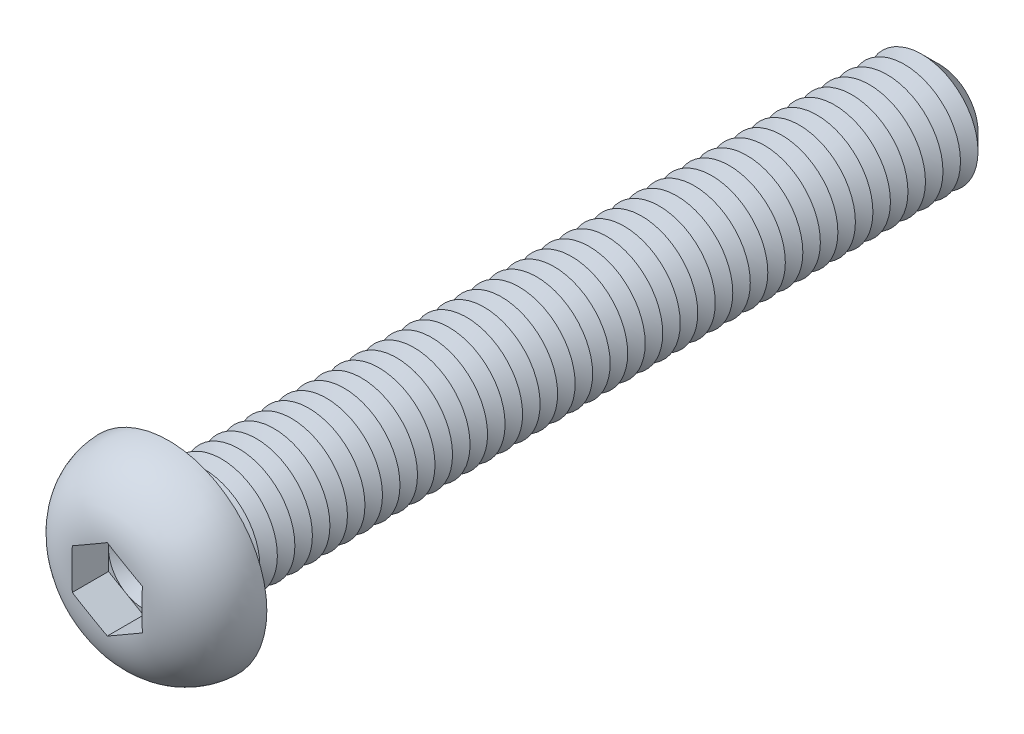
ISO-10303-21;
HEADER;
FILE_DESCRIPTION(('STEP AP214'),'2;1');
FILE_NAME('part.step','',(''),(''),'','','');
FILE_SCHEMA(('AUTOMOTIVE_DESIGN { 1 0 10303 214 1 1 1 1 }'));
ENDSEC;
DATA;
#1=APPLICATION_CONTEXT('core data for automotive mechanical design processes');
#2=APPLICATION_PROTOCOL_DEFINITION('international standard','automotive_design',2000,#1);
#3=PRODUCT_CONTEXT('',#1,'mechanical');
#4=PRODUCT('Part','Part','',(#3));
#5=PRODUCT_RELATED_PRODUCT_CATEGORY('part','',(#4));
#6=PRODUCT_DEFINITION_FORMATION('','',#4);
#7=PRODUCT_DEFINITION_CONTEXT('part definition',#1,'design');
#8=PRODUCT_DEFINITION('design','',#6,#7);
#9=PRODUCT_DEFINITION_SHAPE('','',#8);
#10=(LENGTH_UNIT() NAMED_UNIT(*) SI_UNIT(.MILLI.,.METRE.));
#11=(NAMED_UNIT(*) PLANE_ANGLE_UNIT() SI_UNIT($,.RADIAN.));
#12=(NAMED_UNIT(*) SI_UNIT($,.STERADIAN.) SOLID_ANGLE_UNIT());
#13=UNCERTAINTY_MEASURE_WITH_UNIT(LENGTH_MEASURE(1.E-05),#10,'distance_accuracy_value','');
#14=(GEOMETRIC_REPRESENTATION_CONTEXT(3) GLOBAL_UNCERTAINTY_ASSIGNED_CONTEXT((#13)) GLOBAL_UNIT_ASSIGNED_CONTEXT((#10,
#11,#12)) REPRESENTATION_CONTEXT('',''));
#15=CARTESIAN_POINT('',(0.,0.,0.));
#16=DIRECTION('',(0.,0.,1.));
#17=DIRECTION('',(1.,0.,0.));
#18=AXIS2_PLACEMENT_3D('',#15,#16,#17);
#19=CARTESIAN_POINT('',(0.,0.,1.8));
#20=DIRECTION('',(0.,0.,1.));
#21=DIRECTION('',(1.,0.,0.));
#22=AXIS2_PLACEMENT_3D('',#19,#20,#21);
#23=PLANE('',#22);
#24=CARTESIAN_POINT('',(0.,0.,1.8));
#25=DIRECTION('',(0.,0.,1.));
#26=DIRECTION('',(1.,0.,0.));
#27=AXIS2_PLACEMENT_3D('',#24,#25,#26);
#28=CIRCLE('',#27,2.5);
#29=CARTESIAN_POINT('',(2.5,0.,1.8));
#30=VERTEX_POINT('',#29);
#31=CARTESIAN_POINT('',(1.25,2.1650635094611,1.8));
#32=VERTEX_POINT('',#31);
#33=EDGE_CURVE('E153',#30,#32,#28,.T.);
#34=ORIENTED_EDGE('',*,*,#33,.F.);
#35=DIRECTION('',(0.,1.,0.));
#36=VECTOR('',#35,1.);
#37=CARTESIAN_POINT('',(2.5,-1.44337567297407,1.8));
#38=LINE('',#37,#36);
#39=CARTESIAN_POINT('',(2.5,1.44337567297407,1.8));
#40=VERTEX_POINT('',#39);
#41=EDGE_CURVE('E176',#30,#40,#38,.T.);
#42=ORIENTED_EDGE('',*,*,#41,.T.);
#43=DIRECTION('',(-0.866025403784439,0.5,0.));
#44=VECTOR('',#43,1.);
#45=CARTESIAN_POINT('',(2.5,1.44337567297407,1.8));
#46=LINE('',#45,#44);
#47=EDGE_CURVE('E172',#40,#32,#46,.T.);
#48=ORIENTED_EDGE('',*,*,#47,.T.);
#49=EDGE_LOOP('',(#34,#42,#48));
#50=FACE_BOUND('',#49,.T.);
#51=ADVANCED_FACE('F39',(#50),#23,.T.);
#52=CARTESIAN_POINT('',(0.,0.,1.8));
#53=DIRECTION('',(0.,0.,1.));
#54=DIRECTION('',(1.,0.,0.));
#55=AXIS2_PLACEMENT_3D('',#52,#53,#54);
#56=CIRCLE('',#55,2.5);
#57=CARTESIAN_POINT('',(-1.25,2.1650635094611,1.8));
#58=VERTEX_POINT('',#57);
#59=EDGE_CURVE('E11',#32,#58,#56,.T.);
#60=ORIENTED_EDGE('',*,*,#59,.F.);
#61=CARTESIAN_POINT('',(0.,2.88675134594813,1.8));
#62=VERTEX_POINT('',#61);
#63=EDGE_CURVE('E166',#32,#62,#46,.T.);
#64=ORIENTED_EDGE('',*,*,#63,.T.);
#65=DIRECTION('',(-0.866025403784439,-0.5,0.));
#66=VECTOR('',#65,1.);
#67=CARTESIAN_POINT('',(0.,2.88675134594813,1.8));
#68=LINE('',#67,#66);
#69=EDGE_CURVE('E167',#62,#58,#68,.T.);
#70=ORIENTED_EDGE('',*,*,#69,.T.);
#71=EDGE_LOOP('',(#60,#64,#70));
#72=FACE_BOUND('',#71,.T.);
#73=ADVANCED_FACE('F165',(#72),#23,.T.);
#74=CARTESIAN_POINT('',(-2.5,0.,1.8));
#75=VERTEX_POINT('',#74);
#76=EDGE_CURVE('E49',#58,#75,#56,.T.);
#77=ORIENTED_EDGE('',*,*,#76,.F.);
#78=CARTESIAN_POINT('',(-2.5,1.44337567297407,1.8));
#79=VERTEX_POINT('',#78);
#80=EDGE_CURVE('E179',#58,#79,#68,.T.);
#81=ORIENTED_EDGE('',*,*,#80,.T.);
#82=DIRECTION('',(0.,-1.,0.));
#83=VECTOR('',#82,1.);
#84=CARTESIAN_POINT('',(-2.5,1.44337567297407,1.8));
#85=LINE('',#84,#83);
#86=EDGE_CURVE('E189',#79,#75,#85,.T.);
#87=ORIENTED_EDGE('',*,*,#86,.T.);
#88=EDGE_LOOP('',(#77,#81,#87));
#89=FACE_BOUND('',#88,.T.);
#90=ADVANCED_FACE('F441',(#89),#23,.T.);
#91=CARTESIAN_POINT('',(-1.25,-2.1650635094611,1.8));
#92=VERTEX_POINT('',#91);
#93=EDGE_CURVE('E422',#75,#92,#56,.T.);
#94=ORIENTED_EDGE('',*,*,#93,.F.);
#95=CARTESIAN_POINT('',(-2.5,-1.44337567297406,1.8));
#96=VERTEX_POINT('',#95);
#97=EDGE_CURVE('E188',#75,#96,#85,.T.);
#98=ORIENTED_EDGE('',*,*,#97,.T.);
#99=DIRECTION('',(0.866025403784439,-0.5,0.));
#100=VECTOR('',#99,1.);
#101=CARTESIAN_POINT('',(-2.5,-1.44337567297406,1.8));
#102=LINE('',#101,#100);
#103=EDGE_CURVE('E194',#96,#92,#102,.T.);
#104=ORIENTED_EDGE('',*,*,#103,.T.);
#105=EDGE_LOOP('',(#94,#98,#104));
#106=FACE_BOUND('',#105,.T.);
#107=ADVANCED_FACE('F435',(#106),#23,.T.);
#108=CARTESIAN_POINT('',(1.25,-2.1650635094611,1.8));
#109=VERTEX_POINT('',#108);
#110=EDGE_CURVE('E56',#92,#109,#56,.T.);
#111=ORIENTED_EDGE('',*,*,#110,.F.);
#112=CARTESIAN_POINT('',(0.,-2.88675134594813,1.8));
#113=VERTEX_POINT('',#112);
#114=EDGE_CURVE('E193',#92,#113,#102,.T.);
#115=ORIENTED_EDGE('',*,*,#114,.T.);
#116=DIRECTION('',(0.866025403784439,0.5,0.));
#117=VECTOR('',#116,1.);
#118=CARTESIAN_POINT('',(0.,-2.88675134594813,1.8));
#119=LINE('',#118,#117);
#120=EDGE_CURVE('E199',#113,#109,#119,.T.);
#121=ORIENTED_EDGE('',*,*,#120,.T.);
#122=EDGE_LOOP('',(#111,#115,#121));
#123=FACE_BOUND('',#122,.T.);
#124=ADVANCED_FACE('F474',(#123),#23,.T.);
#125=CARTESIAN_POINT('',(0.,0.,-55.));
#126=DIRECTION('',(0.,0.,1.));
#127=DIRECTION('',(1.,0.,0.));
#128=AXIS2_PLACEMENT_3D('',#125,#126,#127);
#129=CYLINDRICAL_SURFACE('',#128,4.);
#130=CARTESIAN_POINT('',(0.,0.,-0.5));
#131=DIRECTION('',(0.,0.,1.));
#132=DIRECTION('',(1.,0.,0.));
#133=AXIS2_PLACEMENT_3D('',#130,#131,#132);
#134=CIRCLE('',#133,4.);
#135=CARTESIAN_POINT('',(4.,0.,-0.5));
#136=VERTEX_POINT('',#135);
#137=EDGE_CURVE('E410',#136,#136,#134,.F.);
#138=ORIENTED_EDGE('',*,*,#137,.T.);
#139=EDGE_LOOP('',(#138));
#140=FACE_BOUND('',#139,.T.);
#141=CARTESIAN_POINT('',(0.,0.,-1.25));
#142=DIRECTION('',(0.,0.,1.));
#143=DIRECTION('',(1.,0.,0.));
#144=AXIS2_PLACEMENT_3D('',#141,#142,#143);
#145=CIRCLE('',#144,4.00000000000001);
#146=CARTESIAN_POINT('',(4.00000000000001,0.,-1.25));
#147=VERTEX_POINT('',#146);
#148=EDGE_CURVE('E184',#147,#147,#145,.T.);
#149=ORIENTED_EDGE('',*,*,#148,.T.);
#150=EDGE_LOOP('',(#149));
#151=FACE_BOUND('',#150,.T.);
#152=ADVANCED_FACE('F469',(#140,#151),#129,.T.);
#153=CARTESIAN_POINT('',(0.,7.,0.));
#154=DIRECTION('',(0.,0.,1.));
#155=DIRECTION('',(1.,0.,0.));
#156=AXIS2_PLACEMENT_3D('',#153,#154,#155);
#157=PLANE('',#156);
#158=CARTESIAN_POINT('',(0.,0.,0.));
#159=DIRECTION('',(0.,0.,1.));
#160=DIRECTION('',(1.,0.,0.));
#161=AXIS2_PLACEMENT_3D('',#158,#159,#160);
#162=CIRCLE('',#161,4.5);
#163=CARTESIAN_POINT('',(4.5,0.,0.));
#164=VERTEX_POINT('',#163);
#165=EDGE_CURVE('E413',#164,#164,#162,.T.);
#166=ORIENTED_EDGE('',*,*,#165,.T.);
#167=EDGE_LOOP('',(#166));
#168=FACE_BOUND('',#167,.T.);
#169=CARTESIAN_POINT('',(0.,0.,0.));
#170=DIRECTION('',(0.,0.,1.));
#171=DIRECTION('',(1.,0.,0.));
#172=AXIS2_PLACEMENT_3D('',#169,#170,#171);
#173=CIRCLE('',#172,7.);
#174=CARTESIAN_POINT('',(7.,0.,0.));
#175=VERTEX_POINT('',#174);
#176=EDGE_CURVE('E210',#175,#175,#173,.T.);
#177=ORIENTED_EDGE('',*,*,#176,.F.);
#178=EDGE_LOOP('',(#177));
#179=FACE_BOUND('',#178,.T.);
#180=ADVANCED_FACE('F467',(#168,#179),#157,.F.);
#181=CARTESIAN_POINT('',(0.,0.,-0.1));
#182=DIRECTION('',(0.,0.,1.));
#183=DIRECTION('',(1.,0.,0.));
#184=AXIS2_PLACEMENT_3D('',#181,#182,#183);
#185=DEGENERATE_TOROIDAL_SURFACE('',#184,2.5011112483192,4.5,.T.);
#186=CARTESIAN_POINT('',(1.31456088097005,2.12778926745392,4.4));
#187=DIRECTION('',(-0.866025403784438,0.500000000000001,0.));
#188=VECTOR('',#187,1.);
#189=LINE('',#186,#188);
#190=CARTESIAN_POINT('',(1.31456088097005,2.12778926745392,4.4));
#191=VERTEX_POINT('',#190);
#192=CARTESIAN_POINT('',(1.18543911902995,2.20233775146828,4.4));
#193=VERTEX_POINT('',#192);
#194=EDGE_CURVE('E398',#191,#193,#189,.T.);
#195=ORIENTED_EDGE('',*,*,#194,.F.);
#196=CARTESIAN_POINT('',(-0.000200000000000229,2.88686681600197,4.38343536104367));
#197=CARTESIAN_POINT('',(0.103935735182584,2.82674402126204,4.38859262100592));
#198=CARTESIAN_POINT('',(0.208111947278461,2.76659785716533,4.39207570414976));
#199=CARTESIAN_POINT('',(0.416486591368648,2.64629270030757,4.39683754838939));
#200=CARTESIAN_POINT('',(0.520685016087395,2.58613371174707,4.39811670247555));
#201=CARTESIAN_POINT('',(0.729066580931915,2.46582455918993,4.3996156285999));
#202=CARTESIAN_POINT('',(0.833249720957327,2.40567439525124,4.39983556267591));
#203=CARTESIAN_POINT('',(1.04162190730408,2.2853706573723,4.4000276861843));
#204=CARTESIAN_POINT('',(1.14581095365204,2.2252170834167,4.39999986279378));
#205=CARTESIAN_POINT('',(1.35418904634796,2.10490993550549,4.39999986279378));
#206=CARTESIAN_POINT('',(1.45837809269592,2.04475636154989,4.4000276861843));
#207=CARTESIAN_POINT('',(1.66675027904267,1.92445262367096,4.39983556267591));
#208=CARTESIAN_POINT('',(1.77093341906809,1.86430245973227,4.3996156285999));
#209=CARTESIAN_POINT('',(1.97931498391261,1.74399330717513,4.39811670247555));
#210=CARTESIAN_POINT('',(2.08351340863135,1.68383431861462,4.39683754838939));
#211=CARTESIAN_POINT('',(2.29188805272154,1.56352916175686,4.39207570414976));
#212=CARTESIAN_POINT('',(2.39606426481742,1.50338299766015,4.38859262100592));
#213=CARTESIAN_POINT('',(2.5002,1.44326020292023,4.38343536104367));
#214=B_SPLINE_CURVE_WITH_KNOTS('',3,(#196,#197,#198,#199,#200,#201,#202,#203,#204,#205,#206,
#207,#208,#209,#210,#211,#212,#213),.UNSPECIFIED.,.F.,.F.,(4,2,2,2,2,2,2,2,4),(0.,
0.361022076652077,0.721979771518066,1.08288224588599,1.44380339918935,1.80472455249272,
2.16562702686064,2.52658472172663,2.88760679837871),.UNSPECIFIED.);
#215=CARTESIAN_POINT('',(2.5,1.44337567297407,4.38344529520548));
#216=VERTEX_POINT('',#215);
#217=EDGE_CURVE('E354',#191,#216,#214,.T.);
#218=ORIENTED_EDGE('',*,*,#217,.T.);
#219=CARTESIAN_POINT('',(2.5,0.,4.39999986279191));
#220=CARTESIAN_POINT('',(2.5,-0.104697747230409,4.39999811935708));
#221=CARTESIAN_POINT('',(2.5,-0.209395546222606,4.40001551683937));
#222=CARTESIAN_POINT('',(2.5,-0.418792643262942,4.39990807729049));
#223=CARTESIAN_POINT('',(2.5,-0.52349194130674,4.39978323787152));
#224=CARTESIAN_POINT('',(2.5,-0.732936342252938,4.39891238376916));
#225=CARTESIAN_POINT('',(2.5,-0.837681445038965,4.39816609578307));
#226=CARTESIAN_POINT('',(2.5,-1.04715282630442,4.39536239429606));
#227=CARTESIAN_POINT('',(2.5,-1.15187910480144,4.39330498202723));
#228=CARTESIAN_POINT('',(2.5,-1.46476484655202,4.38400647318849));
#229=CARTESIAN_POINT('',(2.5,-1.67286375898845,4.37365196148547));
#230=CARTESIAN_POINT('',(2.5,-2.08783281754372,4.33852954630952));
#231=CARTESIAN_POINT('',(2.5,-2.29470379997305,4.31377296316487));
#232=CARTESIAN_POINT('',(2.5,-2.64451002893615,4.25536510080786));
#233=CARTESIAN_POINT('',(2.5,-2.78823975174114,4.22651785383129));
#234=CARTESIAN_POINT('',(2.5,-3.073224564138,4.15827060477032));
#235=CARTESIAN_POINT('',(2.5,-3.21447933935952,4.11886927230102));
#236=CARTESIAN_POINT('',(2.5,-3.49353952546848,4.02870287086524));
#237=CARTESIAN_POINT('',(2.5,-3.6313402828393,3.97792330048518));
#238=CARTESIAN_POINT('',(2.5,-3.90204977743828,3.86463774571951));
#239=CARTESIAN_POINT('',(2.5,-4.0349587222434,3.8021322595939));
#240=CARTESIAN_POINT('',(2.5,-4.2956525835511,3.66474880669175));
#241=CARTESIAN_POINT('',(2.5,-4.42338586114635,3.58977252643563));
#242=CARTESIAN_POINT('',(2.5,-4.67118559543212,3.42803136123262));
#243=CARTESIAN_POINT('',(2.5,-4.79125159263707,3.3412657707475));
#244=CARTESIAN_POINT('',(2.5,-5.02233156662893,3.15645800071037));
#245=CARTESIAN_POINT('',(2.5,-5.13334771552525,3.05841854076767));
#246=CARTESIAN_POINT('',(2.5,-5.34506083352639,2.85177471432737));
#247=CARTESIAN_POINT('',(2.5,-5.44575933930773,2.74317192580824));
#248=CARTESIAN_POINT('',(2.5,-5.62335564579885,2.53102225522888));
#249=CARTESIAN_POINT('',(2.5,-5.70164721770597,2.42863868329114));
#250=CARTESIAN_POINT('',(2.5,-5.84882394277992,2.21725758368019));
#251=CARTESIAN_POINT('',(2.5,-5.91770588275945,2.10825781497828));
#252=CARTESIAN_POINT('',(2.5,-6.04532926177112,1.88460009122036));
#253=CARTESIAN_POINT('',(2.5,-6.1040794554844,1.76994713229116));
#254=CARTESIAN_POINT('',(2.5,-6.21098181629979,1.53574793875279));
#255=CARTESIAN_POINT('',(2.5,-6.25913021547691,1.41619998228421));
#256=CARTESIAN_POINT('',(2.5,-6.34173830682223,1.18065209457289));
#257=CARTESIAN_POINT('',(2.5,-6.37685491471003,1.06488207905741));
#258=CARTESIAN_POINT('',(2.5,-6.43703913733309,0.830714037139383));
#259=CARTESIAN_POINT('',(2.5,-6.46210319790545,0.712315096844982));
#260=CARTESIAN_POINT('',(2.5,-6.50194044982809,0.473848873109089));
#261=CARTESIAN_POINT('',(2.5,-6.51671856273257,0.353782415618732));
#262=CARTESIAN_POINT('',(2.5,-6.53588982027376,0.112808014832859));
#263=CARTESIAN_POINT('',(2.5,-6.54027911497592,-0.00810022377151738));
#264=CARTESIAN_POINT('',(2.5,-6.53779027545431,-0.365870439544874));
#265=CARTESIAN_POINT('',(2.5,-6.51607942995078,-0.602790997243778));
#266=CARTESIAN_POINT('',(2.5,-6.43310265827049,-1.06957107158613));
#267=CARTESIAN_POINT('',(2.5,-6.3718398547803,-1.29943114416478));
#268=CARTESIAN_POINT('',(2.5,-6.25195024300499,-1.63390601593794));
#269=CARTESIAN_POINT('',(2.5,-6.20730237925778,-1.74371189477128));
#270=CARTESIAN_POINT('',(2.5,-6.10902350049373,-1.95921136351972));
#271=CARTESIAN_POINT('',(2.5,-6.05539567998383,-2.06490639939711));
#272=CARTESIAN_POINT('',(2.5,-5.93955620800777,-2.27152527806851));
#273=CARTESIAN_POINT('',(2.5,-5.87734126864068,-2.37244727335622));
#274=CARTESIAN_POINT('',(2.5,-5.7448545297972,-2.56880727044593));
#275=CARTESIAN_POINT('',(2.5,-5.67458537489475,-2.6642470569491));
#276=CARTESIAN_POINT('',(2.5,-5.52523018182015,-2.85070592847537));
#277=CARTESIAN_POINT('',(2.5,-5.44601185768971,-2.94161901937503));
#278=CARTESIAN_POINT('',(2.5,-5.28044044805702,-3.11663859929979));
#279=CARTESIAN_POINT('',(2.5,-5.194089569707,-3.2007471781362));
#280=CARTESIAN_POINT('',(2.5,-5.01485870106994,-3.36178408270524));
#281=CARTESIAN_POINT('',(2.5,-4.92197538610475,-3.43870870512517));
#282=CARTESIAN_POINT('',(2.5,-4.73045535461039,-3.58495812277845));
#283=CARTESIAN_POINT('',(2.5,-4.6318202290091,-3.65428500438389));
#284=CARTESIAN_POINT('',(2.5,-4.4247626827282,-3.78818551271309));
#285=CARTESIAN_POINT('',(2.5,-4.31609824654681,-3.85238474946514));
#286=CARTESIAN_POINT('',(2.5,-4.0940582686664,-3.97208975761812));
#287=CARTESIAN_POINT('',(2.5,-3.98068153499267,-4.02759331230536));
#288=CARTESIAN_POINT('',(2.5,-3.75029026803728,-4.12981004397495));
#289=CARTESIAN_POINT('',(2.5,-3.63328275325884,-4.17653908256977));
#290=CARTESIAN_POINT('',(2.5,-3.39631992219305,-4.2614893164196));
#291=CARTESIAN_POINT('',(2.5,-3.27636651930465,-4.29971587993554));
#292=CARTESIAN_POINT('',(2.5,-3.00446622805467,-4.37644925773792));
#293=CARTESIAN_POINT('',(2.5,-2.85188931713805,-4.41272455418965));
#294=CARTESIAN_POINT('',(2.5,-2.54443794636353,-4.47385449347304));
#295=CARTESIAN_POINT('',(2.5,-2.3895624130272,-4.49870361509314));
#296=CARTESIAN_POINT('',(2.5,-2.07807451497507,-4.53870829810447));
#297=CARTESIAN_POINT('',(2.5,-1.92145805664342,-4.55383091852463));
#298=CARTESIAN_POINT('',(2.5,-1.60772330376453,-4.57647936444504));
#299=CARTESIAN_POINT('',(2.5,-1.45060502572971,-4.58400543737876));
#300=CARTESIAN_POINT('',(2.5,-1.13432460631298,-4.59416656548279));
#301=CARTESIAN_POINT('',(2.5,-0.975160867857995,-4.59674096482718));
#302=CARTESIAN_POINT('',(2.5,-0.656826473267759,-4.59957813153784));
#303=CARTESIAN_POINT('',(2.5,-0.497655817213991,-4.59984092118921));
#304=CARTESIAN_POINT('',(2.5,-0.179547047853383,-4.60005428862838));
#305=CARTESIAN_POINT('',(2.5,-0.02060893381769,-4.60000532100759));
#306=CARTESIAN_POINT('',(2.5,0.297265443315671,-4.59999304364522));
#307=CARTESIAN_POINT('',(2.5,0.456201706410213,-4.60002973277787));
#308=CARTESIAN_POINT('',(2.5,0.70967559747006,-4.59902611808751));
#309=CARTESIAN_POINT('',(2.5,0.804213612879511,-4.59841616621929));
#310=CARTESIAN_POINT('',(2.5,0.99327694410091,-4.59620676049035));
#311=CARTESIAN_POINT('',(2.5,1.08780225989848,-4.59460730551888));
#312=CARTESIAN_POINT('',(2.5,1.37137837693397,-4.58746770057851));
#313=CARTESIAN_POINT('',(2.5,1.56039301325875,-4.57958602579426));
#314=CARTESIAN_POINT('',(2.5,1.93609462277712,-4.55305686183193));
#315=CARTESIAN_POINT('',(2.5,2.12278756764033,-4.53450331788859));
#316=CARTESIAN_POINT('',(2.5,2.49421016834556,-4.48296248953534));
#317=CARTESIAN_POINT('',(2.5,2.67894050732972,-4.44998040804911));
#318=CARTESIAN_POINT('',(2.5,2.99962701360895,-4.37718406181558));
#319=CARTESIAN_POINT('',(2.5,3.13641465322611,-4.34103978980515));
#320=CARTESIAN_POINT('',(2.5,3.40682838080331,-4.25834226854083));
#321=CARTESIAN_POINT('',(2.5,3.54045461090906,-4.21178948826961));
#322=CARTESIAN_POINT('',(2.5,3.80387940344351,-4.1076796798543));
#323=CARTESIAN_POINT('',(2.5,3.93366385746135,-4.05008679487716));
#324=CARTESIAN_POINT('',(2.5,4.18776789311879,-3.92385886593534));
#325=CARTESIAN_POINT('',(2.5,4.31208736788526,-3.85522360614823));
#326=CARTESIAN_POINT('',(2.5,4.55475418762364,-3.70660227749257));
#327=CARTESIAN_POINT('',(2.5,4.67306276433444,-3.62655275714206));
#328=CARTESIAN_POINT('',(2.5,4.90171316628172,-3.45576294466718));
#329=CARTESIAN_POINT('',(2.5,5.01205476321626,-3.36502234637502));
#330=CARTESIAN_POINT('',(2.5,5.22347091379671,-3.17353376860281));
#331=CARTESIAN_POINT('',(2.5,5.32455555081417,-3.07279693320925));
#332=CARTESIAN_POINT('',(2.5,5.51647993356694,-2.86200023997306));
#333=CARTESIAN_POINT('',(2.5,5.6073208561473,-2.75194145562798));
#334=CARTESIAN_POINT('',(2.5,5.76832451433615,-2.53607083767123));
#335=CARTESIAN_POINT('',(2.5,5.83966300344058,-2.4311337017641));
#336=CARTESIAN_POINT('',(2.5,5.97282702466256,-2.2153291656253));
#337=CARTESIAN_POINT('',(2.5,6.03464926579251,-2.10445973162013));
#338=CARTESIAN_POINT('',(2.5,6.14815657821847,-1.87771731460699));
#339=CARTESIAN_POINT('',(2.5,6.19984675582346,-1.76184688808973));
#340=CARTESIAN_POINT('',(2.5,6.29267395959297,-1.52590109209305));
#341=CARTESIAN_POINT('',(2.5,6.33380720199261,-1.40582423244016));
#342=CARTESIAN_POINT('',(2.5,6.40328888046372,-1.16869740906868));
#343=CARTESIAN_POINT('',(2.5,6.43218419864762,-1.05180738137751));
#344=CARTESIAN_POINT('',(2.5,6.47988151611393,-0.815941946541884));
#345=CARTESIAN_POINT('',(2.5,6.49867991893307,-0.696965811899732));
#346=CARTESIAN_POINT('',(2.5,6.52599950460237,-0.457898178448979));
#347=CARTESIAN_POINT('',(2.5,6.53452634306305,-0.337807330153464));
#348=CARTESIAN_POINT('',(2.5,6.54126106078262,-0.0973214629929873));
#349=CARTESIAN_POINT('',(2.5,6.5394651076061,0.023073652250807));
#350=CARTESIAN_POINT('',(2.5,6.51879545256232,0.379398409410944));
#351=CARTESIAN_POINT('',(2.5,6.48510560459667,0.614630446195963));
#352=CARTESIAN_POINT('',(2.5,6.37872360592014,1.07608887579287));
#353=CARTESIAN_POINT('',(2.5,6.30603128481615,1.3023152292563));
#354=CARTESIAN_POINT('',(2.5,6.16957161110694,1.63028303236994));
#355=CARTESIAN_POINT('',(2.5,6.11941470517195,1.7378698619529));
#356=CARTESIAN_POINT('',(2.5,6.01034124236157,1.94849153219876));
#357=CARTESIAN_POINT('',(2.5,5.9514277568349,2.05152795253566));
#358=CARTESIAN_POINT('',(2.5,5.82528890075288,2.25240256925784));
#359=CARTESIAN_POINT('',(2.5,5.75806159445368,2.35023954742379));
#360=CARTESIAN_POINT('',(2.5,5.61585543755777,2.54005689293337));
#361=CARTESIAN_POINT('',(2.5,5.54087908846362,2.63203913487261));
#362=CARTESIAN_POINT('',(2.5,5.38212190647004,2.81146438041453));
#363=CARTESIAN_POINT('',(2.5,5.29819182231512,2.89877528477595));
#364=CARTESIAN_POINT('',(2.5,5.12353712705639,3.06625194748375));
#365=CARTESIAN_POINT('',(2.5,5.03281455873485,3.14641983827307));
#366=CARTESIAN_POINT('',(2.5,4.84518171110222,3.29930665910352));
#367=CARTESIAN_POINT('',(2.5,4.74826657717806,3.37201962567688));
#368=CARTESIAN_POINT('',(2.5,4.54907485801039,3.50961479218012));
#369=CARTESIAN_POINT('',(2.5,4.44679969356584,3.57449905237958));
#370=CARTESIAN_POINT('',(2.5,4.23202545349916,3.69953578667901));
#371=CARTESIAN_POINT('',(2.5,4.11927203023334,3.75925114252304));
#372=CARTESIAN_POINT('',(2.5,3.88947986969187,3.86977617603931));
#373=CARTESIAN_POINT('',(2.5,3.77244067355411,3.92058489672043));
#374=CARTESIAN_POINT('',(2.5,3.5351804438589,4.0133148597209));
#375=CARTESIAN_POINT('',(2.5,3.41496637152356,4.0552539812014));
#376=CARTESIAN_POINT('',(2.5,3.17195278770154,4.13067246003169));
#377=CARTESIAN_POINT('',(2.5,3.04915378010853,4.16415344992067));
#378=CARTESIAN_POINT('',(2.5,2.80683027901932,4.22194717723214));
#379=CARTESIAN_POINT('',(2.5,2.68738216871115,4.2465834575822));
#380=CARTESIAN_POINT('',(2.5,2.44729214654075,4.28920746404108));
#381=CARTESIAN_POINT('',(2.5,2.32664997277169,4.30719369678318));
#382=CARTESIAN_POINT('',(2.5,2.08450864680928,4.33736171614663));
#383=CARTESIAN_POINT('',(2.5,1.9630086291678,4.3495363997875));
#384=CARTESIAN_POINT('',(2.5,1.71961501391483,4.36908103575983));
#385=CARTESIAN_POINT('',(2.5,1.59772134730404,4.37645009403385));
#386=CARTESIAN_POINT('',(2.5,1.35283283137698,4.38761579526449));
#387=CARTESIAN_POINT('',(2.5,1.22983679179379,4.39138420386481));
#388=CARTESIAN_POINT('',(2.5,0.983808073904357,4.3965493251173));
#389=CARTESIAN_POINT('',(2.5,0.860775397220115,4.3979461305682));
#390=CARTESIAN_POINT('',(2.5,0.614783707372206,4.39958107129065));
#391=CARTESIAN_POINT('',(2.5,0.491824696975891,4.3998199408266));
#392=CARTESIAN_POINT('',(2.5,0.245910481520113,4.40003035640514));
#393=CARTESIAN_POINT('',(2.5,0.122955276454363,4.4000019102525));
#394=CARTESIAN_POINT('',(2.5,0.,4.39999986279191));
#395=B_SPLINE_CURVE_WITH_KNOTS('',3,(#219,#220,#221,#222,#223,#224,#225,#226,#227,#228,#229,
#230,#231,#232,#233,#234,#235,#236,#237,#238,#239,#240,#241,#242,#243,#244,#245,#246,#247,#248,
#249,#250,#251,#252,#253,#254,#255,#256,#257,#258,#259,#260,#261,#262,#263,#264,#265,#266,#267,
#268,#269,#270,#271,#272,#273,#274,#275,#276,#277,#278,#279,#280,#281,#282,#283,#284,#285,#286,
#287,#288,#289,#290,#291,#292,#293,#294,#295,#296,#297,#298,#299,#300,#301,#302,#303,#304,#305,
#306,#307,#308,#309,#310,#311,#312,#313,#314,#315,#316,#317,#318,#319,#320,#321,#322,#323,#324,
#325,#326,#327,#328,#329,#330,#331,#332,#333,#334,#335,#336,#337,#338,#339,#340,#341,#342,#343,
#344,#345,#346,#347,#348,#349,#350,#351,#352,#353,#354,#355,#356,#357,#358,#359,#360,#361,#362,
#363,#364,#365,#366,#367,#368,#369,#370,#371,#372,#373,#374,#375,#376,#377,#378,#379,#380,#381,
#382,#383,#384,#385,#386,#387,#388,#389,#390,#391,#392,#393,#394),.UNSPECIFIED.,.T.,.F.,(4,2,2,
2,2,2,2,2,2,2,2,2,2,2,2,2,2,2,2,2,2,2,2,2,2,2,2,2,2,2,2,2,2,2,2,2,2,2,2,2,2,2,2,2,2,2,2,2,2,2,2,
2,2,2,2,2,2,2,2,2,2,2,2,2,2,2,2,2,2,2,2,2,2,2,2,2,2,2,2,2,2,2,2,2,2,2,2,4),(0.,
0.314093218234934,0.62819170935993,0.942428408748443,1.25666481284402,1.88144147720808,
2.50572771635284,2.94516878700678,3.38466527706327,3.82472511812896,4.26476626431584,
4.70845695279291,5.15217420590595,5.59578464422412,6.03932891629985,6.42549664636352,
6.81179591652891,7.19775970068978,7.58386043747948,7.94635637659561,8.30898036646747,
8.67143073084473,9.03401539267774,9.74414367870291,10.4542159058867,10.8094792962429,
11.1646165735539,11.5198902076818,11.8750475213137,12.2363927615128,12.597626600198,
12.9590456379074,13.3203651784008,13.698597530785,14.0769261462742,14.4545641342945,
14.8319630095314,15.3019396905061,15.7721432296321,16.2439309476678,16.715703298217,
17.1932187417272,17.6707295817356,18.1475442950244,18.6243527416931,18.9079682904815,
19.1915841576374,19.7589248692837,20.3213460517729,20.8835645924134,21.3076400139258,
21.731696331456,22.1571540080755,22.5826200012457,23.0105507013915,23.4384936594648,
23.8659647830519,24.2933867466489,24.6735755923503,25.0538956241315,25.4340234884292,
25.8142874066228,26.1750761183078,26.5359932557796,26.8967115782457,27.2575638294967,
27.9668653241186,28.6761699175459,29.0319382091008,29.3875820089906,29.7433087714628,
30.0989210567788,30.4618400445,30.8246503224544,31.1877485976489,31.5507511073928,
31.9331198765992,32.3155297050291,32.6971611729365,33.0787189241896,33.4443988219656,
33.8101607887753,34.1763686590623,34.54264464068,34.9117697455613,35.2808804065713,
35.6497569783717,36.0186227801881),.UNSPECIFIED.);
#396=CARTESIAN_POINT('',(2.5,0.0745484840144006,4.4));
#397=VERTEX_POINT('',#396);
#398=EDGE_CURVE('E344',#216,#397,#395,.T.);
#399=ORIENTED_EDGE('',*,*,#398,.T.);
#400=CARTESIAN_POINT('',(2.5,-0.0745484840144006,4.4));
#401=DIRECTION('',(0.,1.,0.));
#402=VECTOR('',#401,1.);
#403=LINE('',#400,#402);
#404=CARTESIAN_POINT('',(2.5,-0.0745484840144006,4.4));
#405=VERTEX_POINT('',#404);
#406=EDGE_CURVE('E174',#405,#397,#403,.T.);
#407=ORIENTED_EDGE('',*,*,#406,.F.);
#408=CARTESIAN_POINT('',(2.5,-1.44337567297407,4.38344529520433));
#409=VERTEX_POINT('',#408);
#410=EDGE_CURVE('E355',#405,#409,#395,.T.);
#411=ORIENTED_EDGE('',*,*,#410,.T.);
#412=CARTESIAN_POINT('',(2.5002,-1.44326020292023,4.38343536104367));
#413=CARTESIAN_POINT('',(2.39606426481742,-1.50338299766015,4.38859262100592));
#414=CARTESIAN_POINT('',(2.29188805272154,-1.56352916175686,4.39207570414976));
#415=CARTESIAN_POINT('',(2.08351340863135,-1.68383431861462,4.39683754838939));
#416=CARTESIAN_POINT('',(1.9793149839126,-1.74399330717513,4.39811670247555));
#417=CARTESIAN_POINT('',(1.77093341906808,-1.86430245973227,4.3996156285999));
#418=CARTESIAN_POINT('',(1.66675027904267,-1.92445262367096,4.39983556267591));
#419=CARTESIAN_POINT('',(1.45837809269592,-2.04475636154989,4.4000276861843));
#420=CARTESIAN_POINT('',(1.35418904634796,-2.10490993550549,4.39999986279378));
#421=CARTESIAN_POINT('',(1.14581095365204,-2.2252170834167,4.39999986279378));
#422=CARTESIAN_POINT('',(1.04162190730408,-2.2853706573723,4.4000276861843));
#423=CARTESIAN_POINT('',(0.833249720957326,-2.40567439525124,4.39983556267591));
#424=CARTESIAN_POINT('',(0.729066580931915,-2.46582455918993,4.3996156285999));
#425=CARTESIAN_POINT('',(0.520685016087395,-2.58613371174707,4.39811670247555));
#426=CARTESIAN_POINT('',(0.416486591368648,-2.64629270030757,4.39683754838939));
#427=CARTESIAN_POINT('',(0.208111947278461,-2.76659785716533,4.39207570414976));
#428=CARTESIAN_POINT('',(0.103935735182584,-2.82674402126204,4.38859262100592));
#429=CARTESIAN_POINT('',(-0.000200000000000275,-2.88686681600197,4.38343536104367));
#430=B_SPLINE_CURVE_WITH_KNOTS('',3,(#412,#413,#414,#415,#416,#417,#418,#419,#420,#421,#422,
#423,#424,#425,#426,#427,#428,#429),.UNSPECIFIED.,.F.,.F.,(4,2,2,2,2,2,2,2,4),(0.,
0.361022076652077,0.721979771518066,1.08288224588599,1.44380339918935,1.80472455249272,
2.16562702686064,2.52658472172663,2.88760679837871),.UNSPECIFIED.);
#431=CARTESIAN_POINT('',(1.31456088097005,-2.12778926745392,4.4));
#432=VERTEX_POINT('',#431);
#433=EDGE_CURVE('E331',#409,#432,#430,.T.);
#434=ORIENTED_EDGE('',*,*,#433,.T.);
#435=CARTESIAN_POINT('',(1.18543911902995,-2.20233775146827,4.4));
#436=DIRECTION('',(0.866025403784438,0.500000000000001,0.));
#437=VECTOR('',#436,1.);
#438=LINE('',#435,#437);
#439=CARTESIAN_POINT('',(1.18543911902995,-2.20233775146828,4.4));
#440=VERTEX_POINT('',#439);
#441=EDGE_CURVE('E340',#440,#432,#438,.T.);
#442=ORIENTED_EDGE('',*,*,#441,.F.);
#443=CARTESIAN_POINT('',(0.,-2.88675134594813,4.38344529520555));
#444=VERTEX_POINT('',#443);
#445=EDGE_CURVE('E294',#440,#444,#430,.T.);
#446=ORIENTED_EDGE('',*,*,#445,.T.);
#447=CARTESIAN_POINT('',(0.00019999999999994,-2.88686681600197,4.38343536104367));
#448=CARTESIAN_POINT('',(-0.103935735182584,-2.82674402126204,4.38859262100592));
#449=CARTESIAN_POINT('',(-0.208111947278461,-2.76659785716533,4.39207570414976));
#450=CARTESIAN_POINT('',(-0.416486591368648,-2.64629270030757,4.39683754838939));
#451=CARTESIAN_POINT('',(-0.520685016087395,-2.58613371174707,4.39811670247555));
#452=CARTESIAN_POINT('',(-0.729066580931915,-2.46582455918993,4.3996156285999));
#453=CARTESIAN_POINT('',(-0.833249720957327,-2.40567439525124,4.39983556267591));
#454=CARTESIAN_POINT('',(-1.04162190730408,-2.2853706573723,4.4000276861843));
#455=CARTESIAN_POINT('',(-1.14581095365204,-2.2252170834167,4.39999986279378));
#456=CARTESIAN_POINT('',(-1.35418904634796,-2.10490993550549,4.39999986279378));
#457=CARTESIAN_POINT('',(-1.45837809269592,-2.04475636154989,4.4000276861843));
#458=CARTESIAN_POINT('',(-1.66675027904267,-1.92445262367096,4.39983556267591));
#459=CARTESIAN_POINT('',(-1.77093341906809,-1.86430245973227,4.3996156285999));
#460=CARTESIAN_POINT('',(-1.97931498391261,-1.74399330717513,4.39811670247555));
#461=CARTESIAN_POINT('',(-2.08351340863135,-1.68383431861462,4.39683754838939));
#462=CARTESIAN_POINT('',(-2.29188805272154,-1.56352916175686,4.39207570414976));
#463=CARTESIAN_POINT('',(-2.39606426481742,-1.50338299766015,4.38859262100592));
#464=CARTESIAN_POINT('',(-2.5002,-1.44326020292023,4.38343536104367));
#465=B_SPLINE_CURVE_WITH_KNOTS('',3,(#447,#448,#449,#450,#451,#452,#453,#454,#455,#456,#457,
#458,#459,#460,#461,#462,#463,#464),.UNSPECIFIED.,.F.,.F.,(4,2,2,2,2,2,2,2,4),(0.,
0.361022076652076,0.721979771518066,1.08288224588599,1.44380339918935,1.80472455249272,
2.16562702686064,2.52658472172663,2.88760679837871),.UNSPECIFIED.);
#466=CARTESIAN_POINT('',(-1.18543911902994,-2.20233775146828,4.4));
#467=VERTEX_POINT('',#466);
#468=EDGE_CURVE('E284',#444,#467,#465,.T.);
#469=ORIENTED_EDGE('',*,*,#468,.T.);
#470=CARTESIAN_POINT('',(-1.31456088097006,-2.12778926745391,4.4));
#471=DIRECTION('',(0.86602540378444,-0.499999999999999,0.));
#472=VECTOR('',#471,1.);
#473=LINE('',#470,#472);
#474=CARTESIAN_POINT('',(-1.31456088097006,-2.12778926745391,4.4));
#475=VERTEX_POINT('',#474);
#476=EDGE_CURVE('E1900',#475,#467,#473,.T.);
#477=ORIENTED_EDGE('',*,*,#476,.F.);
#478=CARTESIAN_POINT('',(-2.5,-1.44337567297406,4.38344529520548));
#479=VERTEX_POINT('',#478);
#480=EDGE_CURVE('E295',#475,#479,#465,.T.);
#481=ORIENTED_EDGE('',*,*,#480,.T.);
#482=CARTESIAN_POINT('',(-2.5,0.,4.39999986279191));
#483=CARTESIAN_POINT('',(-2.5,0.104697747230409,4.39999811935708));
#484=CARTESIAN_POINT('',(-2.5,0.209395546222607,4.40001551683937));
#485=CARTESIAN_POINT('',(-2.5,0.418792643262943,4.39990807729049));
#486=CARTESIAN_POINT('',(-2.5,0.523491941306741,4.39978323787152));
#487=CARTESIAN_POINT('',(-2.5,0.732936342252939,4.39891238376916));
#488=CARTESIAN_POINT('',(-2.5,0.837681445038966,4.39816609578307));
#489=CARTESIAN_POINT('',(-2.5,1.04715282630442,4.39536239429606));
#490=CARTESIAN_POINT('',(-2.5,1.15187910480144,4.39330498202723));
#491=CARTESIAN_POINT('',(-2.5,1.46476484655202,4.38400647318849));
#492=CARTESIAN_POINT('',(-2.5,1.67286375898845,4.37365196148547));
#493=CARTESIAN_POINT('',(-2.5,2.08783281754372,4.33852954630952));
#494=CARTESIAN_POINT('',(-2.5,2.29470379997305,4.31377296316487));
#495=CARTESIAN_POINT('',(-2.5,2.64451002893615,4.25536510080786));
#496=CARTESIAN_POINT('',(-2.5,2.78823975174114,4.22651785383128));
#497=CARTESIAN_POINT('',(-2.5,3.073224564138,4.15827060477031));
#498=CARTESIAN_POINT('',(-2.5,3.21447933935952,4.11886927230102));
#499=CARTESIAN_POINT('',(-2.5,3.49353952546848,4.02870287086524));
#500=CARTESIAN_POINT('',(-2.5,3.6313402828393,3.97792330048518));
#501=CARTESIAN_POINT('',(-2.5,3.90204977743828,3.8646377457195));
#502=CARTESIAN_POINT('',(-2.5,4.0349587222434,3.8021322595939));
#503=CARTESIAN_POINT('',(-2.5,4.2956525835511,3.66474880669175));
#504=CARTESIAN_POINT('',(-2.5,4.42338586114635,3.58977252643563));
#505=CARTESIAN_POINT('',(-2.5,4.67118559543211,3.42803136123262));
#506=CARTESIAN_POINT('',(-2.5,4.79125159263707,3.3412657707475));
#507=CARTESIAN_POINT('',(-2.5,5.02233156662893,3.15645800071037));
#508=CARTESIAN_POINT('',(-2.5,5.13334771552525,3.05841854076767));
#509=CARTESIAN_POINT('',(-2.5,5.34506083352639,2.85177471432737));
#510=CARTESIAN_POINT('',(-2.5,5.44575933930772,2.74317192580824));
#511=CARTESIAN_POINT('',(-2.5,5.62335564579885,2.53102225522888));
#512=CARTESIAN_POINT('',(-2.5,5.70164721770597,2.42863868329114));
#513=CARTESIAN_POINT('',(-2.5,5.84882394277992,2.21725758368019));
#514=CARTESIAN_POINT('',(-2.5,5.91770588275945,2.10825781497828));
#515=CARTESIAN_POINT('',(-2.5,6.04532926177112,1.88460009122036));
#516=CARTESIAN_POINT('',(-2.5,6.1040794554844,1.76994713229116));
#517=CARTESIAN_POINT('',(-2.5,6.21098181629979,1.53574793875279));
#518=CARTESIAN_POINT('',(-2.5,6.25913021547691,1.41619998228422));
#519=CARTESIAN_POINT('',(-2.5,6.34173830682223,1.18065209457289));
#520=CARTESIAN_POINT('',(-2.5,6.37685491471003,1.06488207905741));
#521=CARTESIAN_POINT('',(-2.5,6.43703913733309,0.830714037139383));
#522=CARTESIAN_POINT('',(-2.5,6.46210319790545,0.712315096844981));
#523=CARTESIAN_POINT('',(-2.5,6.50194044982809,0.473848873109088));
#524=CARTESIAN_POINT('',(-2.5,6.51671856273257,0.35378241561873));
#525=CARTESIAN_POINT('',(-2.5,6.53588982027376,0.112808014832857));
#526=CARTESIAN_POINT('',(-2.5,6.54027911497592,-0.00810022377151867));
#527=CARTESIAN_POINT('',(-2.5,6.53779027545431,-0.365870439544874));
#528=CARTESIAN_POINT('',(-2.5,6.51607942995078,-0.602790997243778));
#529=CARTESIAN_POINT('',(-2.5,6.43310265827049,-1.06957107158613));
#530=CARTESIAN_POINT('',(-2.5,6.3718398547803,-1.29943114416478));
#531=CARTESIAN_POINT('',(-2.5,6.25195024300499,-1.63390601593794));
#532=CARTESIAN_POINT('',(-2.5,6.20730237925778,-1.74371189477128));
#533=CARTESIAN_POINT('',(-2.5,6.10902350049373,-1.95921136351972));
#534=CARTESIAN_POINT('',(-2.5,6.05539567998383,-2.06490639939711));
#535=CARTESIAN_POINT('',(-2.5,5.93955620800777,-2.27152527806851));
#536=CARTESIAN_POINT('',(-2.5,5.87734126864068,-2.37244727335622));
#537=CARTESIAN_POINT('',(-2.5,5.7448545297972,-2.56880727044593));
#538=CARTESIAN_POINT('',(-2.5,5.67458537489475,-2.6642470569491));
#539=CARTESIAN_POINT('',(-2.5,5.52523018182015,-2.85070592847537));
#540=CARTESIAN_POINT('',(-2.5,5.44601185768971,-2.94161901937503));
#541=CARTESIAN_POINT('',(-2.5,5.28044044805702,-3.11663859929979));
#542=CARTESIAN_POINT('',(-2.5,5.194089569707,-3.2007471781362));
#543=CARTESIAN_POINT('',(-2.5,5.01485870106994,-3.36178408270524));
#544=CARTESIAN_POINT('',(-2.5,4.92197538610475,-3.43870870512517));
#545=CARTESIAN_POINT('',(-2.5,4.73045535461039,-3.58495812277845));
#546=CARTESIAN_POINT('',(-2.5,4.6318202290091,-3.65428500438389));
#547=CARTESIAN_POINT('',(-2.5,4.4247626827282,-3.78818551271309));
#548=CARTESIAN_POINT('',(-2.5,4.31609824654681,-3.85238474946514));
#549=CARTESIAN_POINT('',(-2.5,4.0940582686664,-3.97208975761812));
#550=CARTESIAN_POINT('',(-2.5,3.98068153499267,-4.02759331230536));
#551=CARTESIAN_POINT('',(-2.5,3.75029026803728,-4.12981004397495));
#552=CARTESIAN_POINT('',(-2.5,3.63328275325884,-4.17653908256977));
#553=CARTESIAN_POINT('',(-2.5,3.39631992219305,-4.2614893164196));
#554=CARTESIAN_POINT('',(-2.5,3.27636651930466,-4.29971587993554));
#555=CARTESIAN_POINT('',(-2.5,3.00446622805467,-4.37644925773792));
#556=CARTESIAN_POINT('',(-2.5,2.85188931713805,-4.41272455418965));
#557=CARTESIAN_POINT('',(-2.5,2.54443794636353,-4.47385449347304));
#558=CARTESIAN_POINT('',(-2.5,2.3895624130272,-4.49870361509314));
#559=CARTESIAN_POINT('',(-2.5,2.07807451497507,-4.53870829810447));
#560=CARTESIAN_POINT('',(-2.5,1.92145805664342,-4.55383091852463));
#561=CARTESIAN_POINT('',(-2.5,1.60772330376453,-4.57647936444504));
#562=CARTESIAN_POINT('',(-2.5,1.45060502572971,-4.58400543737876));
#563=CARTESIAN_POINT('',(-2.5,1.13432460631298,-4.59416656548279));
#564=CARTESIAN_POINT('',(-2.5,0.975160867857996,-4.59674096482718));
#565=CARTESIAN_POINT('',(-2.5,0.65682647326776,-4.59957813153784));
#566=CARTESIAN_POINT('',(-2.5,0.497655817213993,-4.59984092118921));
#567=CARTESIAN_POINT('',(-2.5,0.179547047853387,-4.60005428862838));
#568=CARTESIAN_POINT('',(-2.5,0.0206089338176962,-4.60000532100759));
#569=CARTESIAN_POINT('',(-2.5,-0.297265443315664,-4.59999304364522));
#570=CARTESIAN_POINT('',(-2.5,-0.456201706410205,-4.60002973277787));
#571=CARTESIAN_POINT('',(-2.5,-0.709675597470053,-4.59902611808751));
#572=CARTESIAN_POINT('',(-2.5,-0.804213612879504,-4.59841616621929));
#573=CARTESIAN_POINT('',(-2.5,-0.993276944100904,-4.59620676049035));
#574=CARTESIAN_POINT('',(-2.5,-1.08780225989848,-4.59460730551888));
#575=CARTESIAN_POINT('',(-2.5,-1.37137837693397,-4.58746770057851));
#576=CARTESIAN_POINT('',(-2.5,-1.56039301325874,-4.57958602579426));
#577=CARTESIAN_POINT('',(-2.5,-1.93609462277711,-4.55305686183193));
#578=CARTESIAN_POINT('',(-2.5,-2.12278756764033,-4.53450331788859));
#579=CARTESIAN_POINT('',(-2.5,-2.49421016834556,-4.48296248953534));
#580=CARTESIAN_POINT('',(-2.5,-2.67894050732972,-4.44998040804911));
#581=CARTESIAN_POINT('',(-2.5,-2.99962701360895,-4.37718406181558));
#582=CARTESIAN_POINT('',(-2.5,-3.13641465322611,-4.34103978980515));
#583=CARTESIAN_POINT('',(-2.5,-3.40682838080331,-4.25834226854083));
#584=CARTESIAN_POINT('',(-2.5,-3.54045461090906,-4.21178948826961));
#585=CARTESIAN_POINT('',(-2.5,-3.8038794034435,-4.1076796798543));
#586=CARTESIAN_POINT('',(-2.5,-3.93366385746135,-4.05008679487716));
#587=CARTESIAN_POINT('',(-2.5,-4.18776789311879,-3.92385886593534));
#588=CARTESIAN_POINT('',(-2.5,-4.31208736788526,-3.85522360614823));
#589=CARTESIAN_POINT('',(-2.5,-4.55475418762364,-3.70660227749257));
#590=CARTESIAN_POINT('',(-2.5,-4.67306276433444,-3.62655275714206));
#591=CARTESIAN_POINT('',(-2.5,-4.90171316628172,-3.45576294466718));
#592=CARTESIAN_POINT('',(-2.5,-5.01205476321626,-3.36502234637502));
#593=CARTESIAN_POINT('',(-2.5,-5.2234709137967,-3.17353376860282));
#594=CARTESIAN_POINT('',(-2.5,-5.32455555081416,-3.07279693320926));
#595=CARTESIAN_POINT('',(-2.5,-5.51647993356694,-2.86200023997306));
#596=CARTESIAN_POINT('',(-2.5,-5.6073208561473,-2.75194145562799));
#597=CARTESIAN_POINT('',(-2.5,-5.76832451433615,-2.53607083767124));
#598=CARTESIAN_POINT('',(-2.5,-5.83966300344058,-2.4311337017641));
#599=CARTESIAN_POINT('',(-2.5,-5.97282702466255,-2.2153291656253));
#600=CARTESIAN_POINT('',(-2.5,-6.03464926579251,-2.10445973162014));
#601=CARTESIAN_POINT('',(-2.5,-6.14815657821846,-1.877717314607));
#602=CARTESIAN_POINT('',(-2.5,-6.19984675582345,-1.76184688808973));
#603=CARTESIAN_POINT('',(-2.5,-6.29267395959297,-1.52590109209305));
#604=CARTESIAN_POINT('',(-2.5,-6.33380720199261,-1.40582423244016));
#605=CARTESIAN_POINT('',(-2.5,-6.40328888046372,-1.16869740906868));
#606=CARTESIAN_POINT('',(-2.5,-6.43218419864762,-1.05180738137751));
#607=CARTESIAN_POINT('',(-2.5,-6.47988151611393,-0.815941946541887));
#608=CARTESIAN_POINT('',(-2.5,-6.49867991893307,-0.696965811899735));
#609=CARTESIAN_POINT('',(-2.5,-6.52599950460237,-0.457898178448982));
#610=CARTESIAN_POINT('',(-2.5,-6.53452634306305,-0.337807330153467));
#611=CARTESIAN_POINT('',(-2.5,-6.54126106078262,-0.09732146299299));
#612=CARTESIAN_POINT('',(-2.5,-6.5394651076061,0.0230736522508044));
#613=CARTESIAN_POINT('',(-2.5,-6.51879545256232,0.379398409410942));
#614=CARTESIAN_POINT('',(-2.5,-6.48510560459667,0.614630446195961));
#615=CARTESIAN_POINT('',(-2.5,-6.37872360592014,1.07608887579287));
#616=CARTESIAN_POINT('',(-2.5,-6.30603128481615,1.3023152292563));
#617=CARTESIAN_POINT('',(-2.5,-6.16957161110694,1.63028303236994));
#618=CARTESIAN_POINT('',(-2.5,-6.11941470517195,1.7378698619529));
#619=CARTESIAN_POINT('',(-2.5,-6.01034124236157,1.94849153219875));
#620=CARTESIAN_POINT('',(-2.5,-5.9514277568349,2.05152795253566));
#621=CARTESIAN_POINT('',(-2.5,-5.82528890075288,2.25240256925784));
#622=CARTESIAN_POINT('',(-2.5,-5.75806159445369,2.35023954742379));
#623=CARTESIAN_POINT('',(-2.5,-5.61585543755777,2.54005689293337));
#624=CARTESIAN_POINT('',(-2.5,-5.54087908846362,2.63203913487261));
#625=CARTESIAN_POINT('',(-2.5,-5.38212190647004,2.81146438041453));
#626=CARTESIAN_POINT('',(-2.5,-5.29819182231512,2.89877528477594));
#627=CARTESIAN_POINT('',(-2.5,-5.1235371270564,3.06625194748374));
#628=CARTESIAN_POINT('',(-2.5,-5.03281455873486,3.14641983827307));
#629=CARTESIAN_POINT('',(-2.5,-4.84518171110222,3.29930665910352));
#630=CARTESIAN_POINT('',(-2.5,-4.74826657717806,3.37201962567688));
#631=CARTESIAN_POINT('',(-2.5,-4.54907485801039,3.50961479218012));
#632=CARTESIAN_POINT('',(-2.5,-4.44679969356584,3.57449905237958));
#633=CARTESIAN_POINT('',(-2.5,-4.23202545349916,3.69953578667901));
#634=CARTESIAN_POINT('',(-2.5,-4.11927203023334,3.75925114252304));
#635=CARTESIAN_POINT('',(-2.5,-3.88947986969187,3.86977617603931));
#636=CARTESIAN_POINT('',(-2.5,-3.77244067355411,3.92058489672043));
#637=CARTESIAN_POINT('',(-2.5,-3.5351804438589,4.0133148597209));
#638=CARTESIAN_POINT('',(-2.5,-3.41496637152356,4.0552539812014));
#639=CARTESIAN_POINT('',(-2.5,-3.17195278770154,4.13067246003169));
#640=CARTESIAN_POINT('',(-2.5,-3.04915378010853,4.16415344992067));
#641=CARTESIAN_POINT('',(-2.5,-2.80683027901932,4.22194717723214));
#642=CARTESIAN_POINT('',(-2.5,-2.68738216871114,4.2465834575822));
#643=CARTESIAN_POINT('',(-2.5,-2.44729214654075,4.28920746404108));
#644=CARTESIAN_POINT('',(-2.5,-2.32664997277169,4.30719369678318));
#645=CARTESIAN_POINT('',(-2.5,-2.08450864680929,4.33736171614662));
#646=CARTESIAN_POINT('',(-2.5,-1.96300862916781,4.34953639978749));
#647=CARTESIAN_POINT('',(-2.5,-1.71961501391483,4.36908103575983));
#648=CARTESIAN_POINT('',(-2.5,-1.59772134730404,4.37645009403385));
#649=CARTESIAN_POINT('',(-2.5,-1.35283283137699,4.38761579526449));
#650=CARTESIAN_POINT('',(-2.5,-1.2298367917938,4.39138420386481));
#651=CARTESIAN_POINT('',(-2.5,-0.983808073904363,4.3965493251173));
#652=CARTESIAN_POINT('',(-2.5,-0.860775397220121,4.3979461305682));
#653=CARTESIAN_POINT('',(-2.5,-0.61478370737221,4.39958107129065));
#654=CARTESIAN_POINT('',(-2.5,-0.491824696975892,4.3998199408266));
#655=CARTESIAN_POINT('',(-2.5,-0.245910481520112,4.40003035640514));
#656=CARTESIAN_POINT('',(-2.5,-0.122955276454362,4.4000019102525));
#657=CARTESIAN_POINT('',(-2.5,0.,4.39999986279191));
#658=B_SPLINE_CURVE_WITH_KNOTS('',3,(#482,#483,#484,#485,#486,#487,#488,#489,#490,#491,#492,
#493,#494,#495,#496,#497,#498,#499,#500,#501,#502,#503,#504,#505,#506,#507,#508,#509,#510,#511,
#512,#513,#514,#515,#516,#517,#518,#519,#520,#521,#522,#523,#524,#525,#526,#527,#528,#529,#530,
#531,#532,#533,#534,#535,#536,#537,#538,#539,#540,#541,#542,#543,#544,#545,#546,#547,#548,#549,
#550,#551,#552,#553,#554,#555,#556,#557,#558,#559,#560,#561,#562,#563,#564,#565,#566,#567,#568,
#569,#570,#571,#572,#573,#574,#575,#576,#577,#578,#579,#580,#581,#582,#583,#584,#585,#586,#587,
#588,#589,#590,#591,#592,#593,#594,#595,#596,#597,#598,#599,#600,#601,#602,#603,#604,#605,#606,
#607,#608,#609,#610,#611,#612,#613,#614,#615,#616,#617,#618,#619,#620,#621,#622,#623,#624,#625,
#626,#627,#628,#629,#630,#631,#632,#633,#634,#635,#636,#637,#638,#639,#640,#641,#642,#643,#644,
#645,#646,#647,#648,#649,#650,#651,#652,#653,#654,#655,#656,#657),.UNSPECIFIED.,.T.,.F.,(4,2,2,
2,2,2,2,2,2,2,2,2,2,2,2,2,2,2,2,2,2,2,2,2,2,2,2,2,2,2,2,2,2,2,2,2,2,2,2,2,2,2,2,2,2,2,2,2,2,2,2,
2,2,2,2,2,2,2,2,2,2,2,2,2,2,2,2,2,2,2,2,2,2,2,2,2,2,2,2,2,2,2,2,2,2,2,2,4),(0.,
0.314093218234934,0.62819170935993,0.942428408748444,1.25666481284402,1.88144147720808,
2.50572771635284,2.94516878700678,3.38466527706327,3.82472511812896,4.26476626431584,
4.70845695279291,5.15217420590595,5.59578464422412,6.03932891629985,6.42549664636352,
6.8117959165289,7.19775970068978,7.58386043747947,7.94635637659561,8.30898036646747,
8.67143073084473,9.03401539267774,9.74414367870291,10.4542159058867,10.8094792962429,
11.1646165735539,11.5198902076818,11.8750475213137,12.2363927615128,12.597626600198,
12.9590456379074,13.3203651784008,13.698597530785,14.0769261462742,14.4545641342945,
14.8319630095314,15.3019396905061,15.7721432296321,16.2439309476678,16.715703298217,
17.1932187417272,17.6707295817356,18.1475442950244,18.6243527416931,18.9079682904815,
19.1915841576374,19.7589248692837,20.3213460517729,20.8835645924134,21.3076400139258,
21.731696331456,22.1571540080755,22.5826200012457,23.0105507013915,23.4384936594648,
23.8659647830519,24.2933867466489,24.6735755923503,25.0538956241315,25.4340234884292,
25.8142874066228,26.1750761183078,26.5359932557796,26.8967115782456,27.2575638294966,
27.9668653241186,28.6761699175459,29.0319382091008,29.3875820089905,29.7433087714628,
30.0989210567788,30.4618400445,30.8246503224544,31.1877485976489,31.5507511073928,
31.9331198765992,32.3155297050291,32.6971611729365,33.0787189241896,33.4443988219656,
33.8101607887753,34.1763686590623,34.5426446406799,34.9117697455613,35.2808804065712,
35.6497569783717,36.0186227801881),.UNSPECIFIED.);
#659=CARTESIAN_POINT('',(-2.5,-0.0745484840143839,4.4));
#660=VERTEX_POINT('',#659);
#661=EDGE_CURVE('E268',#479,#660,#658,.T.);
#662=ORIENTED_EDGE('',*,*,#661,.T.);
#663=CARTESIAN_POINT('',(-2.5,0.0745484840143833,4.4));
#664=DIRECTION('',(0.,-1.,0.));
#665=VECTOR('',#664,1.);
#666=LINE('',#663,#665);
#667=CARTESIAN_POINT('',(-2.5,0.0745484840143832,4.4));
#668=VERTEX_POINT('',#667);
#669=EDGE_CURVE('E280',#668,#660,#666,.T.);
#670=ORIENTED_EDGE('',*,*,#669,.F.);
#671=CARTESIAN_POINT('',(-2.5,1.44337567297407,4.38344529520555));
#672=VERTEX_POINT('',#671);
#673=EDGE_CURVE('E271',#668,#672,#658,.T.);
#674=ORIENTED_EDGE('',*,*,#673,.T.);
#675=CARTESIAN_POINT('',(-2.5002,1.44326020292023,4.38343536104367));
#676=CARTESIAN_POINT('',(-2.39606426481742,1.50338299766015,4.38859262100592));
#677=CARTESIAN_POINT('',(-2.29188805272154,1.56352916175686,4.39207570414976));
#678=CARTESIAN_POINT('',(-2.08351340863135,1.68383431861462,4.39683754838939));
#679=CARTESIAN_POINT('',(-1.97931498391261,1.74399330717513,4.39811670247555));
#680=CARTESIAN_POINT('',(-1.77093341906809,1.86430245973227,4.3996156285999));
#681=CARTESIAN_POINT('',(-1.66675027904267,1.92445262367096,4.39983556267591));
#682=CARTESIAN_POINT('',(-1.45837809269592,2.04475636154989,4.4000276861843));
#683=CARTESIAN_POINT('',(-1.35418904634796,2.10490993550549,4.39999986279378));
#684=CARTESIAN_POINT('',(-1.14581095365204,2.2252170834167,4.39999986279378));
#685=CARTESIAN_POINT('',(-1.04162190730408,2.2853706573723,4.4000276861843));
#686=CARTESIAN_POINT('',(-0.833249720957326,2.40567439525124,4.39983556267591));
#687=CARTESIAN_POINT('',(-0.729066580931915,2.46582455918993,4.3996156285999));
#688=CARTESIAN_POINT('',(-0.520685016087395,2.58613371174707,4.39811670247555));
#689=CARTESIAN_POINT('',(-0.416486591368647,2.64629270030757,4.39683754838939));
#690=CARTESIAN_POINT('',(-0.208111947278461,2.76659785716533,4.39207570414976));
#691=CARTESIAN_POINT('',(-0.103935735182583,2.82674402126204,4.38859262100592));
#692=CARTESIAN_POINT('',(0.000200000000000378,2.88686681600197,4.38343536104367));
#693=B_SPLINE_CURVE_WITH_KNOTS('',3,(#675,#676,#677,#678,#679,#680,#681,#682,#683,#684,#685,
#686,#687,#688,#689,#690,#691,#692),.UNSPECIFIED.,.F.,.F.,(4,2,2,2,2,2,2,2,4),(0.,
0.361022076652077,0.721979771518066,1.08288224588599,1.44380339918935,1.80472455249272,
2.16562702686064,2.52658472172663,2.88760679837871),.UNSPECIFIED.);
#694=CARTESIAN_POINT('',(-1.31456088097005,2.12778926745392,4.4));
#695=VERTEX_POINT('',#694);
#696=EDGE_CURVE('E275',#672,#695,#693,.T.);
#697=ORIENTED_EDGE('',*,*,#696,.T.);
#698=CARTESIAN_POINT('',(-1.18543911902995,2.20233775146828,4.4));
#699=DIRECTION('',(-0.866025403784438,-0.500000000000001,0.));
#700=VECTOR('',#699,1.);
#701=LINE('',#698,#700);
#702=CARTESIAN_POINT('',(-1.18543911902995,2.20233775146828,4.4));
#703=VERTEX_POINT('',#702);
#704=EDGE_CURVE('E447',#703,#695,#701,.T.);
#705=ORIENTED_EDGE('',*,*,#704,.F.);
#706=CARTESIAN_POINT('',(0.,2.88675134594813,4.38344529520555));
#707=VERTEX_POINT('',#706);
#708=EDGE_CURVE('E452',#703,#707,#693,.T.);
#709=ORIENTED_EDGE('',*,*,#708,.T.);
#710=EDGE_CURVE('E388',#707,#193,#214,.T.);
#711=ORIENTED_EDGE('',*,*,#710,.T.);
#712=EDGE_LOOP('',(#195,#218,#399,#407,#411,#434,#442,#446,#469,#477,#481,#662,#670,#674,#697,
#705,#709,#711));
#713=FACE_BOUND('',#712,.T.);
#714=ORIENTED_EDGE('',*,*,#176,.T.);
#715=EDGE_LOOP('',(#714));
#716=FACE_BOUND('',#715,.T.);
#717=ADVANCED_FACE('F239',(#713,#716),#185,.T.);
#718=CARTESIAN_POINT('',(2.5,1.44337567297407,1.8));
#719=DIRECTION('',(0.5,0.866025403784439,0.));
#720=DIRECTION('',(-0.866025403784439,0.5,0.));
#721=AXIS2_PLACEMENT_3D('',#718,#719,#720);
#722=PLANE('',#721);
#723=DIRECTION('',(0.,0.,1.));
#724=VECTOR('',#723,1.);
#725=CARTESIAN_POINT('',(0.,2.88675134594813,1.8));
#726=LINE('',#725,#724);
#727=EDGE_CURVE('E64',#62,#707,#726,.T.);
#728=ORIENTED_EDGE('',*,*,#727,.F.);
#729=ORIENTED_EDGE('',*,*,#63,.F.);
#730=ORIENTED_EDGE('',*,*,#47,.F.);
#731=DIRECTION('',(0.,0.,1.));
#732=VECTOR('',#731,1.);
#733=CARTESIAN_POINT('',(2.5,1.44337567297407,1.8));
#734=LINE('',#733,#732);
#735=EDGE_CURVE('E207',#40,#216,#734,.T.);
#736=ORIENTED_EDGE('',*,*,#735,.T.);
#737=ORIENTED_EDGE('',*,*,#217,.F.);
#738=ORIENTED_EDGE('',*,*,#194,.T.);
#739=ORIENTED_EDGE('',*,*,#710,.F.);
#740=EDGE_LOOP('',(#728,#729,#730,#736,#737,#738,#739));
#741=FACE_BOUND('',#740,.T.);
#742=ADVANCED_FACE('F170',(#741),#722,.F.);
#743=CARTESIAN_POINT('',(2.5,-1.44337567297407,1.8));
#744=DIRECTION('',(1.,0.,0.));
#745=DIRECTION('',(0.,0.,-1.));
#746=AXIS2_PLACEMENT_3D('',#743,#744,#745);
#747=PLANE('',#746);
#748=ORIENTED_EDGE('',*,*,#406,.T.);
#749=ORIENTED_EDGE('',*,*,#398,.F.);
#750=ORIENTED_EDGE('',*,*,#735,.F.);
#751=ORIENTED_EDGE('',*,*,#41,.F.);
#752=CARTESIAN_POINT('',(2.5,-1.44337567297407,1.8));
#753=VERTEX_POINT('',#752);
#754=EDGE_CURVE('E203',#753,#30,#38,.T.);
#755=ORIENTED_EDGE('',*,*,#754,.F.);
#756=DIRECTION('',(0.,0.,1.));
#757=VECTOR('',#756,1.);
#758=CARTESIAN_POINT('',(2.5,-1.44337567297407,1.8));
#759=LINE('',#758,#757);
#760=EDGE_CURVE('E211',#753,#409,#759,.T.);
#761=ORIENTED_EDGE('',*,*,#760,.T.);
#762=ORIENTED_EDGE('',*,*,#410,.F.);
#763=EDGE_LOOP('',(#748,#749,#750,#751,#755,#761,#762));
#764=FACE_BOUND('',#763,.T.);
#765=ADVANCED_FACE('F365',(#764),#747,.F.);
#766=CARTESIAN_POINT('',(0.,-2.88675134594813,1.8));
#767=DIRECTION('',(0.5,-0.866025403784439,0.));
#768=DIRECTION('',(0.866025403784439,0.5,0.));
#769=AXIS2_PLACEMENT_3D('',#766,#767,#768);
#770=PLANE('',#769);
#771=ORIENTED_EDGE('',*,*,#760,.F.);
#772=EDGE_CURVE('E198',#109,#753,#119,.T.);
#773=ORIENTED_EDGE('',*,*,#772,.F.);
#774=ORIENTED_EDGE('',*,*,#120,.F.);
#775=DIRECTION('',(0.,0.,1.));
#776=VECTOR('',#775,1.);
#777=CARTESIAN_POINT('',(0.,-2.88675134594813,1.8));
#778=LINE('',#777,#776);
#779=EDGE_CURVE('E215',#113,#444,#778,.T.);
#780=ORIENTED_EDGE('',*,*,#779,.T.);
#781=ORIENTED_EDGE('',*,*,#445,.F.);
#782=ORIENTED_EDGE('',*,*,#441,.T.);
#783=ORIENTED_EDGE('',*,*,#433,.F.);
#784=EDGE_LOOP('',(#771,#773,#774,#780,#781,#782,#783));
#785=FACE_BOUND('',#784,.T.);
#786=ADVANCED_FACE('F310',(#785),#770,.F.);
#787=CARTESIAN_POINT('',(-2.5,-1.44337567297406,1.8));
#788=DIRECTION('',(-0.5,-0.866025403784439,0.));
#789=DIRECTION('',(0.866025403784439,-0.5,0.));
#790=AXIS2_PLACEMENT_3D('',#787,#788,#789);
#791=PLANE('',#790);
#792=ORIENTED_EDGE('',*,*,#779,.F.);
#793=ORIENTED_EDGE('',*,*,#114,.F.);
#794=ORIENTED_EDGE('',*,*,#103,.F.);
#795=DIRECTION('',(0.,0.,1.));
#796=VECTOR('',#795,1.);
#797=CARTESIAN_POINT('',(-2.5,-1.44337567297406,1.8));
#798=LINE('',#797,#796);
#799=EDGE_CURVE('E219',#96,#479,#798,.T.);
#800=ORIENTED_EDGE('',*,*,#799,.T.);
#801=ORIENTED_EDGE('',*,*,#480,.F.);
#802=ORIENTED_EDGE('',*,*,#476,.T.);
#803=ORIENTED_EDGE('',*,*,#468,.F.);
#804=EDGE_LOOP('',(#792,#793,#794,#800,#801,#802,#803));
#805=FACE_BOUND('',#804,.T.);
#806=ADVANCED_FACE('F306',(#805),#791,.F.);
#807=CARTESIAN_POINT('',(-2.5,1.44337567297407,1.8));
#808=DIRECTION('',(-1.,0.,0.));
#809=DIRECTION('',(0.,-1.,0.));
#810=AXIS2_PLACEMENT_3D('',#807,#808,#809);
#811=PLANE('',#810);
#812=ORIENTED_EDGE('',*,*,#669,.T.);
#813=ORIENTED_EDGE('',*,*,#661,.F.);
#814=ORIENTED_EDGE('',*,*,#799,.F.);
#815=ORIENTED_EDGE('',*,*,#97,.F.);
#816=ORIENTED_EDGE('',*,*,#86,.F.);
#817=DIRECTION('',(0.,0.,1.));
#818=VECTOR('',#817,1.);
#819=CARTESIAN_POINT('',(-2.5,1.44337567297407,1.8));
#820=LINE('',#819,#818);
#821=EDGE_CURVE('E223',#79,#672,#820,.T.);
#822=ORIENTED_EDGE('',*,*,#821,.T.);
#823=ORIENTED_EDGE('',*,*,#673,.F.);
#824=EDGE_LOOP('',(#812,#813,#814,#815,#816,#822,#823));
#825=FACE_BOUND('',#824,.T.);
#826=ADVANCED_FACE('F248',(#825),#811,.F.);
#827=CARTESIAN_POINT('',(0.,2.88675134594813,1.8));
#828=DIRECTION('',(-0.5,0.866025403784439,0.));
#829=DIRECTION('',(-0.866025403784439,-0.5,0.));
#830=AXIS2_PLACEMENT_3D('',#827,#828,#829);
#831=PLANE('',#830);
#832=ORIENTED_EDGE('',*,*,#821,.F.);
#833=ORIENTED_EDGE('',*,*,#80,.F.);
#834=ORIENTED_EDGE('',*,*,#69,.F.);
#835=ORIENTED_EDGE('',*,*,#727,.T.);
#836=ORIENTED_EDGE('',*,*,#708,.F.);
#837=ORIENTED_EDGE('',*,*,#704,.T.);
#838=ORIENTED_EDGE('',*,*,#696,.F.);
#839=EDGE_LOOP('',(#832,#833,#834,#835,#836,#837,#838));
#840=FACE_BOUND('',#839,.T.);
#841=ADVANCED_FACE('F243',(#840),#831,.F.);
#842=EDGE_CURVE('E43',#109,#30,#56,.T.);
#843=ORIENTED_EDGE('',*,*,#842,.F.);
#844=ORIENTED_EDGE('',*,*,#772,.T.);
#845=ORIENTED_EDGE('',*,*,#754,.T.);
#846=EDGE_LOOP('',(#843,#844,#845));
#847=FACE_BOUND('',#846,.T.);
#848=ADVANCED_FACE('F247',(#847),#23,.T.);
#849=CARTESIAN_POINT('',(0.,0.,-1.25));
#850=DIRECTION('',(0.,0.,1.));
#851=DIRECTION('',(1.,0.,0.));
#852=AXIS2_PLACEMENT_3D('',#849,#850,#851);
#853=CONICAL_SURFACE('',#852,4.00000000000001,1.0471975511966);
#854=CARTESIAN_POINT('',(0.,0.,-1.875));
#855=DIRECTION('',(0.,0.,1.));
#856=DIRECTION('',(1.,0.,0.));
#857=AXIS2_PLACEMENT_3D('',#854,#855,#856);
#858=CIRCLE('',#857,2.91746824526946);
#859=CARTESIAN_POINT('',(2.91746824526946,0.,-1.875));
#860=VERTEX_POINT('',#859);
#861=EDGE_CURVE('E536',#860,#860,#858,.T.);
#862=ORIENTED_EDGE('',*,*,#861,.T.);
#863=EDGE_LOOP('',(#862));
#864=FACE_BOUND('',#863,.T.);
#865=ORIENTED_EDGE('',*,*,#148,.F.);
#866=EDGE_LOOP('',(#865));
#867=FACE_BOUND('',#866,.T.);
#868=ADVANCED_FACE('F481',(#864,#867),#853,.T.);
#869=CARTESIAN_POINT('',(0.,0.,-1.875));
#870=DIRECTION('',(0.,0.,-1.));
#871=DIRECTION('',(-1.,0.,0.));
#872=AXIS2_PLACEMENT_3D('',#869,#870,#871);
#873=CONICAL_SURFACE('',#872,2.91746824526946,1.0471975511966);
#874=CARTESIAN_POINT('',(0.,0.,-2.5));
#875=DIRECTION('',(0.,0.,1.));
#876=DIRECTION('',(1.,0.,0.));
#877=AXIS2_PLACEMENT_3D('',#874,#875,#876);
#878=CIRCLE('',#877,4.00000000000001);
#879=CARTESIAN_POINT('',(4.00000000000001,0.,-2.5));
#880=VERTEX_POINT('',#879);
#881=EDGE_CURVE('E533',#880,#880,#878,.T.);
#882=ORIENTED_EDGE('',*,*,#881,.T.);
#883=EDGE_LOOP('',(#882));
#884=FACE_BOUND('',#883,.T.);
#885=ORIENTED_EDGE('',*,*,#861,.F.);
#886=EDGE_LOOP('',(#885));
#887=FACE_BOUND('',#886,.T.);
#888=ADVANCED_FACE('F486',(#884,#887),#873,.T.);
#889=CARTESIAN_POINT('',(0.,0.,-2.5));
#890=DIRECTION('',(0.,0.,1.));
#891=DIRECTION('',(1.,0.,0.));
#892=AXIS2_PLACEMENT_3D('',#889,#890,#891);
#893=CONICAL_SURFACE('',#892,4.00000000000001,1.0471975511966);
#894=CARTESIAN_POINT('',(0.,0.,-3.125));
#895=DIRECTION('',(0.,0.,1.));
#896=DIRECTION('',(1.,0.,0.));
#897=AXIS2_PLACEMENT_3D('',#894,#895,#896);
#898=CIRCLE('',#897,2.91746824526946);
#899=CARTESIAN_POINT('',(2.91746824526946,0.,-3.125));
#900=VERTEX_POINT('',#899);
#901=EDGE_CURVE('E530',#900,#900,#898,.T.);
#902=ORIENTED_EDGE('',*,*,#901,.T.);
#903=EDGE_LOOP('',(#902));
#904=FACE_BOUND('',#903,.T.);
#905=ORIENTED_EDGE('',*,*,#881,.F.);
#906=EDGE_LOOP('',(#905));
#907=FACE_BOUND('',#906,.T.);
#908=ADVANCED_FACE('F1163',(#904,#907),#893,.T.);
#909=CARTESIAN_POINT('',(0.,0.,-3.125));
#910=DIRECTION('',(0.,0.,-1.));
#911=DIRECTION('',(-1.,0.,0.));
#912=AXIS2_PLACEMENT_3D('',#909,#910,#911);
#913=CONICAL_SURFACE('',#912,2.91746824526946,1.0471975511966);
#914=CARTESIAN_POINT('',(0.,0.,-3.75));
#915=DIRECTION('',(0.,0.,1.));
#916=DIRECTION('',(1.,0.,0.));
#917=AXIS2_PLACEMENT_3D('',#914,#915,#916);
#918=CIRCLE('',#917,4.00000000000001);
#919=CARTESIAN_POINT('',(4.00000000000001,0.,-3.75));
#920=VERTEX_POINT('',#919);
#921=EDGE_CURVE('E534',#920,#920,#918,.T.);
#922=ORIENTED_EDGE('',*,*,#921,.T.);
#923=EDGE_LOOP('',(#922));
#924=FACE_BOUND('',#923,.T.);
#925=ORIENTED_EDGE('',*,*,#901,.F.);
#926=EDGE_LOOP('',(#925));
#927=FACE_BOUND('',#926,.T.);
#928=ADVANCED_FACE('F1159',(#924,#927),#913,.T.);
#929=CARTESIAN_POINT('',(0.,0.,-3.75));
#930=DIRECTION('',(0.,0.,1.));
#931=DIRECTION('',(1.,0.,0.));
#932=AXIS2_PLACEMENT_3D('',#929,#930,#931);
#933=CONICAL_SURFACE('',#932,4.00000000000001,1.0471975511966);
#934=CARTESIAN_POINT('',(0.,0.,-4.375));
#935=DIRECTION('',(0.,0.,1.));
#936=DIRECTION('',(1.,0.,0.));
#937=AXIS2_PLACEMENT_3D('',#934,#935,#936);
#938=CIRCLE('',#937,2.91746824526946);
#939=CARTESIAN_POINT('',(2.91746824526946,0.,-4.375));
#940=VERTEX_POINT('',#939);
#941=EDGE_CURVE('E547',#940,#940,#938,.T.);
#942=ORIENTED_EDGE('',*,*,#941,.T.);
#943=EDGE_LOOP('',(#942));
#944=FACE_BOUND('',#943,.T.);
#945=ORIENTED_EDGE('',*,*,#921,.F.);
#946=EDGE_LOOP('',(#945));
#947=FACE_BOUND('',#946,.T.);
#948=ADVANCED_FACE('F1155',(#944,#947),#933,.T.);
#949=CARTESIAN_POINT('',(0.,0.,-4.375));
#950=DIRECTION('',(0.,0.,-1.));
#951=DIRECTION('',(-1.,0.,0.));
#952=AXIS2_PLACEMENT_3D('',#949,#950,#951);
#953=CONICAL_SURFACE('',#952,2.91746824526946,1.0471975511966);
#954=CARTESIAN_POINT('',(0.,0.,-5.));
#955=DIRECTION('',(0.,0.,1.));
#956=DIRECTION('',(1.,0.,0.));
#957=AXIS2_PLACEMENT_3D('',#954,#955,#956);
#958=CIRCLE('',#957,4.00000000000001);
#959=CARTESIAN_POINT('',(4.00000000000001,0.,-5.));
#960=VERTEX_POINT('',#959);
#961=EDGE_CURVE('E551',#960,#960,#958,.T.);
#962=ORIENTED_EDGE('',*,*,#961,.T.);
#963=EDGE_LOOP('',(#962));
#964=FACE_BOUND('',#963,.T.);
#965=ORIENTED_EDGE('',*,*,#941,.F.);
#966=EDGE_LOOP('',(#965));
#967=FACE_BOUND('',#966,.T.);
#968=ADVANCED_FACE('F1151',(#964,#967),#953,.T.);
#969=CARTESIAN_POINT('',(0.,0.,-5.));
#970=DIRECTION('',(0.,0.,1.));
#971=DIRECTION('',(1.,0.,0.));
#972=AXIS2_PLACEMENT_3D('',#969,#970,#971);
#973=CONICAL_SURFACE('',#972,4.00000000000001,1.0471975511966);
#974=CARTESIAN_POINT('',(0.,0.,-5.625));
#975=DIRECTION('',(0.,0.,1.));
#976=DIRECTION('',(1.,0.,0.));
#977=AXIS2_PLACEMENT_3D('',#974,#975,#976);
#978=CIRCLE('',#977,2.91746824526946);
#979=CARTESIAN_POINT('',(2.91746824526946,0.,-5.625));
#980=VERTEX_POINT('',#979);
#981=EDGE_CURVE('E555',#980,#980,#978,.T.);
#982=ORIENTED_EDGE('',*,*,#981,.T.);
#983=EDGE_LOOP('',(#982));
#984=FACE_BOUND('',#983,.T.);
#985=ORIENTED_EDGE('',*,*,#961,.F.);
#986=EDGE_LOOP('',(#985));
#987=FACE_BOUND('',#986,.T.);
#988=ADVANCED_FACE('F1147',(#984,#987),#973,.T.);
#989=CARTESIAN_POINT('',(0.,0.,-5.625));
#990=DIRECTION('',(0.,0.,-1.));
#991=DIRECTION('',(-1.,0.,0.));
#992=AXIS2_PLACEMENT_3D('',#989,#990,#991);
#993=CONICAL_SURFACE('',#992,2.91746824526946,1.0471975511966);
#994=CARTESIAN_POINT('',(0.,0.,-6.25));
#995=DIRECTION('',(0.,0.,1.));
#996=DIRECTION('',(1.,0.,0.));
#997=AXIS2_PLACEMENT_3D('',#994,#995,#996);
#998=CIRCLE('',#997,4.00000000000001);
#999=CARTESIAN_POINT('',(4.00000000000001,0.,-6.25));
#1000=VERTEX_POINT('',#999);
#1001=EDGE_CURVE('E558',#1000,#1000,#998,.T.);
#1002=ORIENTED_EDGE('',*,*,#1001,.T.);
#1003=EDGE_LOOP('',(#1002));
#1004=FACE_BOUND('',#1003,.T.);
#1005=ORIENTED_EDGE('',*,*,#981,.F.);
#1006=EDGE_LOOP('',(#1005));
#1007=FACE_BOUND('',#1006,.T.);
#1008=ADVANCED_FACE('F1143',(#1004,#1007),#993,.T.);
#1009=CARTESIAN_POINT('',(0.,0.,-6.25));
#1010=DIRECTION('',(0.,0.,1.));
#1011=DIRECTION('',(1.,0.,0.));
#1012=AXIS2_PLACEMENT_3D('',#1009,#1010,#1011);
#1013=CONICAL_SURFACE('',#1012,4.00000000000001,1.0471975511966);
#1014=CARTESIAN_POINT('',(0.,0.,-6.875));
#1015=DIRECTION('',(0.,0.,1.));
#1016=DIRECTION('',(1.,0.,0.));
#1017=AXIS2_PLACEMENT_3D('',#1014,#1015,#1016);
#1018=CIRCLE('',#1017,2.91746824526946);
#1019=CARTESIAN_POINT('',(2.91746824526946,0.,-6.875));
#1020=VERTEX_POINT('',#1019);
#1021=EDGE_CURVE('E562',#1020,#1020,#1018,.T.);
#1022=ORIENTED_EDGE('',*,*,#1021,.T.);
#1023=EDGE_LOOP('',(#1022));
#1024=FACE_BOUND('',#1023,.T.);
#1025=ORIENTED_EDGE('',*,*,#1001,.F.);
#1026=EDGE_LOOP('',(#1025));
#1027=FACE_BOUND('',#1026,.T.);
#1028=ADVANCED_FACE('F1139',(#1024,#1027),#1013,.T.);
#1029=CARTESIAN_POINT('',(0.,0.,-6.875));
#1030=DIRECTION('',(0.,0.,-1.));
#1031=DIRECTION('',(-1.,0.,0.));
#1032=AXIS2_PLACEMENT_3D('',#1029,#1030,#1031);
#1033=CONICAL_SURFACE('',#1032,2.91746824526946,1.0471975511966);
#1034=CARTESIAN_POINT('',(0.,0.,-7.5));
#1035=DIRECTION('',(0.,0.,1.));
#1036=DIRECTION('',(1.,0.,0.));
#1037=AXIS2_PLACEMENT_3D('',#1034,#1035,#1036);
#1038=CIRCLE('',#1037,4.00000000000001);
#1039=CARTESIAN_POINT('',(4.00000000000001,0.,-7.5));
#1040=VERTEX_POINT('',#1039);
#1041=EDGE_CURVE('E566',#1040,#1040,#1038,.T.);
#1042=ORIENTED_EDGE('',*,*,#1041,.T.);
#1043=EDGE_LOOP('',(#1042));
#1044=FACE_BOUND('',#1043,.T.);
#1045=ORIENTED_EDGE('',*,*,#1021,.F.);
#1046=EDGE_LOOP('',(#1045));
#1047=FACE_BOUND('',#1046,.T.);
#1048=ADVANCED_FACE('F1135',(#1044,#1047),#1033,.T.);
#1049=CARTESIAN_POINT('',(0.,0.,-7.5));
#1050=DIRECTION('',(0.,0.,1.));
#1051=DIRECTION('',(1.,0.,0.));
#1052=AXIS2_PLACEMENT_3D('',#1049,#1050,#1051);
#1053=CONICAL_SURFACE('',#1052,4.00000000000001,1.0471975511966);
#1054=CARTESIAN_POINT('',(0.,0.,-8.125));
#1055=DIRECTION('',(0.,0.,1.));
#1056=DIRECTION('',(1.,0.,0.));
#1057=AXIS2_PLACEMENT_3D('',#1054,#1055,#1056);
#1058=CIRCLE('',#1057,2.91746824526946);
#1059=CARTESIAN_POINT('',(2.91746824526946,0.,-8.125));
#1060=VERTEX_POINT('',#1059);
#1061=EDGE_CURVE('E570',#1060,#1060,#1058,.T.);
#1062=ORIENTED_EDGE('',*,*,#1061,.T.);
#1063=EDGE_LOOP('',(#1062));
#1064=FACE_BOUND('',#1063,.T.);
#1065=ORIENTED_EDGE('',*,*,#1041,.F.);
#1066=EDGE_LOOP('',(#1065));
#1067=FACE_BOUND('',#1066,.T.);
#1068=ADVANCED_FACE('F1131',(#1064,#1067),#1053,.T.);
#1069=CARTESIAN_POINT('',(0.,0.,-8.125));
#1070=DIRECTION('',(0.,0.,-1.));
#1071=DIRECTION('',(-1.,0.,0.));
#1072=AXIS2_PLACEMENT_3D('',#1069,#1070,#1071);
#1073=CONICAL_SURFACE('',#1072,2.91746824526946,1.0471975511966);
#1074=CARTESIAN_POINT('',(0.,0.,-8.75));
#1075=DIRECTION('',(0.,0.,1.));
#1076=DIRECTION('',(1.,0.,0.));
#1077=AXIS2_PLACEMENT_3D('',#1074,#1075,#1076);
#1078=CIRCLE('',#1077,4.00000000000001);
#1079=CARTESIAN_POINT('',(4.00000000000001,0.,-8.75));
#1080=VERTEX_POINT('',#1079);
#1081=EDGE_CURVE('E574',#1080,#1080,#1078,.T.);
#1082=ORIENTED_EDGE('',*,*,#1081,.T.);
#1083=EDGE_LOOP('',(#1082));
#1084=FACE_BOUND('',#1083,.T.);
#1085=ORIENTED_EDGE('',*,*,#1061,.F.);
#1086=EDGE_LOOP('',(#1085));
#1087=FACE_BOUND('',#1086,.T.);
#1088=ADVANCED_FACE('F1127',(#1084,#1087),#1073,.T.);
#1089=CARTESIAN_POINT('',(0.,0.,-8.75));
#1090=DIRECTION('',(0.,0.,1.));
#1091=DIRECTION('',(1.,0.,0.));
#1092=AXIS2_PLACEMENT_3D('',#1089,#1090,#1091);
#1093=CONICAL_SURFACE('',#1092,4.00000000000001,1.0471975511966);
#1094=CARTESIAN_POINT('',(0.,0.,-9.375));
#1095=DIRECTION('',(0.,0.,1.));
#1096=DIRECTION('',(1.,0.,0.));
#1097=AXIS2_PLACEMENT_3D('',#1094,#1095,#1096);
#1098=CIRCLE('',#1097,2.91746824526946);
#1099=CARTESIAN_POINT('',(2.91746824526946,0.,-9.375));
#1100=VERTEX_POINT('',#1099);
#1101=EDGE_CURVE('E577',#1100,#1100,#1098,.T.);
#1102=ORIENTED_EDGE('',*,*,#1101,.T.);
#1103=EDGE_LOOP('',(#1102));
#1104=FACE_BOUND('',#1103,.T.);
#1105=ORIENTED_EDGE('',*,*,#1081,.F.);
#1106=EDGE_LOOP('',(#1105));
#1107=FACE_BOUND('',#1106,.T.);
#1108=ADVANCED_FACE('F1123',(#1104,#1107),#1093,.T.);
#1109=CARTESIAN_POINT('',(0.,0.,-9.375));
#1110=DIRECTION('',(0.,0.,-1.));
#1111=DIRECTION('',(-1.,0.,0.));
#1112=AXIS2_PLACEMENT_3D('',#1109,#1110,#1111);
#1113=CONICAL_SURFACE('',#1112,2.91746824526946,1.0471975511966);
#1114=CARTESIAN_POINT('',(0.,0.,-10.));
#1115=DIRECTION('',(0.,0.,1.));
#1116=DIRECTION('',(1.,0.,0.));
#1117=AXIS2_PLACEMENT_3D('',#1114,#1115,#1116);
#1118=CIRCLE('',#1117,4.00000000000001);
#1119=CARTESIAN_POINT('',(4.00000000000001,0.,-10.));
#1120=VERTEX_POINT('',#1119);
#1121=EDGE_CURVE('E580',#1120,#1120,#1118,.T.);
#1122=ORIENTED_EDGE('',*,*,#1121,.T.);
#1123=EDGE_LOOP('',(#1122));
#1124=FACE_BOUND('',#1123,.T.);
#1125=ORIENTED_EDGE('',*,*,#1101,.F.);
#1126=EDGE_LOOP('',(#1125));
#1127=FACE_BOUND('',#1126,.T.);
#1128=ADVANCED_FACE('F1119',(#1124,#1127),#1113,.T.);
#1129=CARTESIAN_POINT('',(0.,0.,-10.));
#1130=DIRECTION('',(0.,0.,1.));
#1131=DIRECTION('',(1.,0.,0.));
#1132=AXIS2_PLACEMENT_3D('',#1129,#1130,#1131);
#1133=CONICAL_SURFACE('',#1132,4.00000000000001,1.0471975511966);
#1134=CARTESIAN_POINT('',(0.,0.,-10.625));
#1135=DIRECTION('',(0.,0.,1.));
#1136=DIRECTION('',(1.,0.,0.));
#1137=AXIS2_PLACEMENT_3D('',#1134,#1135,#1136);
#1138=CIRCLE('',#1137,2.91746824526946);
#1139=CARTESIAN_POINT('',(2.91746824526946,0.,-10.625));
#1140=VERTEX_POINT('',#1139);
#1141=EDGE_CURVE('E584',#1140,#1140,#1138,.T.);
#1142=ORIENTED_EDGE('',*,*,#1141,.T.);
#1143=EDGE_LOOP('',(#1142));
#1144=FACE_BOUND('',#1143,.T.);
#1145=ORIENTED_EDGE('',*,*,#1121,.F.);
#1146=EDGE_LOOP('',(#1145));
#1147=FACE_BOUND('',#1146,.T.);
#1148=ADVANCED_FACE('F1115',(#1144,#1147),#1133,.T.);
#1149=CARTESIAN_POINT('',(0.,0.,-10.625));
#1150=DIRECTION('',(0.,0.,-1.));
#1151=DIRECTION('',(-1.,0.,0.));
#1152=AXIS2_PLACEMENT_3D('',#1149,#1150,#1151);
#1153=CONICAL_SURFACE('',#1152,2.91746824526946,1.0471975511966);
#1154=CARTESIAN_POINT('',(0.,0.,-11.25));
#1155=DIRECTION('',(0.,0.,1.));
#1156=DIRECTION('',(1.,0.,0.));
#1157=AXIS2_PLACEMENT_3D('',#1154,#1155,#1156);
#1158=CIRCLE('',#1157,4.00000000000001);
#1159=CARTESIAN_POINT('',(4.00000000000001,0.,-11.25));
#1160=VERTEX_POINT('',#1159);
#1161=EDGE_CURVE('E588',#1160,#1160,#1158,.T.);
#1162=ORIENTED_EDGE('',*,*,#1161,.T.);
#1163=EDGE_LOOP('',(#1162));
#1164=FACE_BOUND('',#1163,.T.);
#1165=ORIENTED_EDGE('',*,*,#1141,.F.);
#1166=EDGE_LOOP('',(#1165));
#1167=FACE_BOUND('',#1166,.T.);
#1168=ADVANCED_FACE('F1111',(#1164,#1167),#1153,.T.);
#1169=CARTESIAN_POINT('',(0.,0.,-11.25));
#1170=DIRECTION('',(0.,0.,1.));
#1171=DIRECTION('',(1.,0.,0.));
#1172=AXIS2_PLACEMENT_3D('',#1169,#1170,#1171);
#1173=CONICAL_SURFACE('',#1172,4.00000000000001,1.0471975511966);
#1174=CARTESIAN_POINT('',(0.,0.,-11.875));
#1175=DIRECTION('',(0.,0.,1.));
#1176=DIRECTION('',(1.,0.,0.));
#1177=AXIS2_PLACEMENT_3D('',#1174,#1175,#1176);
#1178=CIRCLE('',#1177,2.91746824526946);
#1179=CARTESIAN_POINT('',(2.91746824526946,0.,-11.875));
#1180=VERTEX_POINT('',#1179);
#1181=EDGE_CURVE('E592',#1180,#1180,#1178,.T.);
#1182=ORIENTED_EDGE('',*,*,#1181,.T.);
#1183=EDGE_LOOP('',(#1182));
#1184=FACE_BOUND('',#1183,.T.);
#1185=ORIENTED_EDGE('',*,*,#1161,.F.);
#1186=EDGE_LOOP('',(#1185));
#1187=FACE_BOUND('',#1186,.T.);
#1188=ADVANCED_FACE('F1107',(#1184,#1187),#1173,.T.);
#1189=CARTESIAN_POINT('',(0.,0.,-11.875));
#1190=DIRECTION('',(0.,0.,-1.));
#1191=DIRECTION('',(-1.,0.,0.));
#1192=AXIS2_PLACEMENT_3D('',#1189,#1190,#1191);
#1193=CONICAL_SURFACE('',#1192,2.91746824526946,1.0471975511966);
#1194=CARTESIAN_POINT('',(0.,0.,-12.5));
#1195=DIRECTION('',(0.,0.,1.));
#1196=DIRECTION('',(1.,0.,0.));
#1197=AXIS2_PLACEMENT_3D('',#1194,#1195,#1196);
#1198=CIRCLE('',#1197,4.00000000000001);
#1199=CARTESIAN_POINT('',(4.00000000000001,0.,-12.5));
#1200=VERTEX_POINT('',#1199);
#1201=EDGE_CURVE('E527',#1200,#1200,#1198,.T.);
#1202=ORIENTED_EDGE('',*,*,#1201,.T.);
#1203=EDGE_LOOP('',(#1202));
#1204=FACE_BOUND('',#1203,.T.);
#1205=ORIENTED_EDGE('',*,*,#1181,.F.);
#1206=EDGE_LOOP('',(#1205));
#1207=FACE_BOUND('',#1206,.T.);
#1208=ADVANCED_FACE('F1103',(#1204,#1207),#1193,.T.);
#1209=CARTESIAN_POINT('',(0.,0.,-12.5));
#1210=DIRECTION('',(0.,0.,1.));
#1211=DIRECTION('',(1.,0.,0.));
#1212=AXIS2_PLACEMENT_3D('',#1209,#1210,#1211);
#1213=CONICAL_SURFACE('',#1212,4.00000000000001,1.0471975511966);
#1214=CARTESIAN_POINT('',(0.,0.,-13.125));
#1215=DIRECTION('',(0.,0.,1.));
#1216=DIRECTION('',(1.,0.,0.));
#1217=AXIS2_PLACEMENT_3D('',#1214,#1215,#1216);
#1218=CIRCLE('',#1217,2.91746824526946);
#1219=CARTESIAN_POINT('',(2.91746824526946,0.,-13.125));
#1220=VERTEX_POINT('',#1219);
#1221=EDGE_CURVE('E524',#1220,#1220,#1218,.T.);
#1222=ORIENTED_EDGE('',*,*,#1221,.T.);
#1223=EDGE_LOOP('',(#1222));
#1224=FACE_BOUND('',#1223,.T.);
#1225=ORIENTED_EDGE('',*,*,#1201,.F.);
#1226=EDGE_LOOP('',(#1225));
#1227=FACE_BOUND('',#1226,.T.);
#1228=ADVANCED_FACE('F1099',(#1224,#1227),#1213,.T.);
#1229=CARTESIAN_POINT('',(0.,0.,-13.125));
#1230=DIRECTION('',(0.,0.,-1.));
#1231=DIRECTION('',(-1.,0.,0.));
#1232=AXIS2_PLACEMENT_3D('',#1229,#1230,#1231);
#1233=CONICAL_SURFACE('',#1232,2.91746824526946,1.0471975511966);
#1234=CARTESIAN_POINT('',(0.,0.,-13.75));
#1235=DIRECTION('',(0.,0.,1.));
#1236=DIRECTION('',(1.,0.,0.));
#1237=AXIS2_PLACEMENT_3D('',#1234,#1235,#1236);
#1238=CIRCLE('',#1237,4.00000000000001);
#1239=CARTESIAN_POINT('',(4.00000000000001,0.,-13.75));
#1240=VERTEX_POINT('',#1239);
#1241=EDGE_CURVE('E528',#1240,#1240,#1238,.T.);
#1242=ORIENTED_EDGE('',*,*,#1241,.T.);
#1243=EDGE_LOOP('',(#1242));
#1244=FACE_BOUND('',#1243,.T.);
#1245=ORIENTED_EDGE('',*,*,#1221,.F.);
#1246=EDGE_LOOP('',(#1245));
#1247=FACE_BOUND('',#1246,.T.);
#1248=ADVANCED_FACE('F1095',(#1244,#1247),#1233,.T.);
#1249=CARTESIAN_POINT('',(0.,0.,-13.75));
#1250=DIRECTION('',(0.,0.,1.));
#1251=DIRECTION('',(1.,0.,0.));
#1252=AXIS2_PLACEMENT_3D('',#1249,#1250,#1251);
#1253=CONICAL_SURFACE('',#1252,4.00000000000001,1.0471975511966);
#1254=CARTESIAN_POINT('',(0.,0.,-14.375));
#1255=DIRECTION('',(0.,0.,1.));
#1256=DIRECTION('',(1.,0.,0.));
#1257=AXIS2_PLACEMENT_3D('',#1254,#1255,#1256);
#1258=CIRCLE('',#1257,2.91746824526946);
#1259=CARTESIAN_POINT('',(2.91746824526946,0.,-14.375));
#1260=VERTEX_POINT('',#1259);
#1261=EDGE_CURVE('E602',#1260,#1260,#1258,.T.);
#1262=ORIENTED_EDGE('',*,*,#1261,.T.);
#1263=EDGE_LOOP('',(#1262));
#1264=FACE_BOUND('',#1263,.T.);
#1265=ORIENTED_EDGE('',*,*,#1241,.F.);
#1266=EDGE_LOOP('',(#1265));
#1267=FACE_BOUND('',#1266,.T.);
#1268=ADVANCED_FACE('F1091',(#1264,#1267),#1253,.T.);
#1269=CARTESIAN_POINT('',(0.,0.,-14.375));
#1270=DIRECTION('',(0.,0.,-1.));
#1271=DIRECTION('',(-1.,0.,0.));
#1272=AXIS2_PLACEMENT_3D('',#1269,#1270,#1271);
#1273=CONICAL_SURFACE('',#1272,2.91746824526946,1.0471975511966);
#1274=CARTESIAN_POINT('',(0.,0.,-15.));
#1275=DIRECTION('',(0.,0.,1.));
#1276=DIRECTION('',(1.,0.,0.));
#1277=AXIS2_PLACEMENT_3D('',#1274,#1275,#1276);
#1278=CIRCLE('',#1277,4.00000000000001);
#1279=CARTESIAN_POINT('',(4.00000000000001,0.,-15.));
#1280=VERTEX_POINT('',#1279);
#1281=EDGE_CURVE('E606',#1280,#1280,#1278,.T.);
#1282=ORIENTED_EDGE('',*,*,#1281,.T.);
#1283=EDGE_LOOP('',(#1282));
#1284=FACE_BOUND('',#1283,.T.);
#1285=ORIENTED_EDGE('',*,*,#1261,.F.);
#1286=EDGE_LOOP('',(#1285));
#1287=FACE_BOUND('',#1286,.T.);
#1288=ADVANCED_FACE('F1087',(#1284,#1287),#1273,.T.);
#1289=CARTESIAN_POINT('',(0.,0.,-15.));
#1290=DIRECTION('',(0.,0.,1.));
#1291=DIRECTION('',(1.,0.,0.));
#1292=AXIS2_PLACEMENT_3D('',#1289,#1290,#1291);
#1293=CONICAL_SURFACE('',#1292,4.00000000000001,1.0471975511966);
#1294=CARTESIAN_POINT('',(0.,0.,-15.625));
#1295=DIRECTION('',(0.,0.,1.));
#1296=DIRECTION('',(1.,0.,0.));
#1297=AXIS2_PLACEMENT_3D('',#1294,#1295,#1296);
#1298=CIRCLE('',#1297,2.91746824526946);
#1299=CARTESIAN_POINT('',(2.91746824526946,0.,-15.625));
#1300=VERTEX_POINT('',#1299);
#1301=EDGE_CURVE('E610',#1300,#1300,#1298,.T.);
#1302=ORIENTED_EDGE('',*,*,#1301,.T.);
#1303=EDGE_LOOP('',(#1302));
#1304=FACE_BOUND('',#1303,.T.);
#1305=ORIENTED_EDGE('',*,*,#1281,.F.);
#1306=EDGE_LOOP('',(#1305));
#1307=FACE_BOUND('',#1306,.T.);
#1308=ADVANCED_FACE('F1083',(#1304,#1307),#1293,.T.);
#1309=CARTESIAN_POINT('',(0.,0.,-15.625));
#1310=DIRECTION('',(0.,0.,-1.));
#1311=DIRECTION('',(-1.,0.,0.));
#1312=AXIS2_PLACEMENT_3D('',#1309,#1310,#1311);
#1313=CONICAL_SURFACE('',#1312,2.91746824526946,1.0471975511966);
#1314=CARTESIAN_POINT('',(0.,0.,-16.25));
#1315=DIRECTION('',(0.,0.,1.));
#1316=DIRECTION('',(1.,0.,0.));
#1317=AXIS2_PLACEMENT_3D('',#1314,#1315,#1316);
#1318=CIRCLE('',#1317,4.00000000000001);
#1319=CARTESIAN_POINT('',(4.00000000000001,0.,-16.25));
#1320=VERTEX_POINT('',#1319);
#1321=EDGE_CURVE('E614',#1320,#1320,#1318,.T.);
#1322=ORIENTED_EDGE('',*,*,#1321,.T.);
#1323=EDGE_LOOP('',(#1322));
#1324=FACE_BOUND('',#1323,.T.);
#1325=ORIENTED_EDGE('',*,*,#1301,.F.);
#1326=EDGE_LOOP('',(#1325));
#1327=FACE_BOUND('',#1326,.T.);
#1328=ADVANCED_FACE('F1079',(#1324,#1327),#1313,.T.);
#1329=CARTESIAN_POINT('',(0.,0.,-16.25));
#1330=DIRECTION('',(0.,0.,1.));
#1331=DIRECTION('',(1.,0.,0.));
#1332=AXIS2_PLACEMENT_3D('',#1329,#1330,#1331);
#1333=CONICAL_SURFACE('',#1332,4.00000000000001,1.0471975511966);
#1334=CARTESIAN_POINT('',(0.,0.,-16.875));
#1335=DIRECTION('',(0.,0.,1.));
#1336=DIRECTION('',(1.,0.,0.));
#1337=AXIS2_PLACEMENT_3D('',#1334,#1335,#1336);
#1338=CIRCLE('',#1337,2.91746824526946);
#1339=CARTESIAN_POINT('',(2.91746824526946,0.,-16.875));
#1340=VERTEX_POINT('',#1339);
#1341=EDGE_CURVE('E618',#1340,#1340,#1338,.T.);
#1342=ORIENTED_EDGE('',*,*,#1341,.T.);
#1343=EDGE_LOOP('',(#1342));
#1344=FACE_BOUND('',#1343,.T.);
#1345=ORIENTED_EDGE('',*,*,#1321,.F.);
#1346=EDGE_LOOP('',(#1345));
#1347=FACE_BOUND('',#1346,.T.);
#1348=ADVANCED_FACE('F1075',(#1344,#1347),#1333,.T.);
#1349=CARTESIAN_POINT('',(0.,0.,-16.875));
#1350=DIRECTION('',(0.,0.,-1.));
#1351=DIRECTION('',(-1.,0.,0.));
#1352=AXIS2_PLACEMENT_3D('',#1349,#1350,#1351);
#1353=CONICAL_SURFACE('',#1352,2.91746824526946,1.0471975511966);
#1354=CARTESIAN_POINT('',(0.,0.,-17.5));
#1355=DIRECTION('',(0.,0.,1.));
#1356=DIRECTION('',(1.,0.,0.));
#1357=AXIS2_PLACEMENT_3D('',#1354,#1355,#1356);
#1358=CIRCLE('',#1357,4.00000000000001);
#1359=CARTESIAN_POINT('',(4.00000000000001,0.,-17.5));
#1360=VERTEX_POINT('',#1359);
#1361=EDGE_CURVE('E621',#1360,#1360,#1358,.T.);
#1362=ORIENTED_EDGE('',*,*,#1361,.T.);
#1363=EDGE_LOOP('',(#1362));
#1364=FACE_BOUND('',#1363,.T.);
#1365=ORIENTED_EDGE('',*,*,#1341,.F.);
#1366=EDGE_LOOP('',(#1365));
#1367=FACE_BOUND('',#1366,.T.);
#1368=ADVANCED_FACE('F1071',(#1364,#1367),#1353,.T.);
#1369=CARTESIAN_POINT('',(0.,0.,-17.5));
#1370=DIRECTION('',(0.,0.,1.));
#1371=DIRECTION('',(1.,0.,0.));
#1372=AXIS2_PLACEMENT_3D('',#1369,#1370,#1371);
#1373=CONICAL_SURFACE('',#1372,4.00000000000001,1.0471975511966);
#1374=CARTESIAN_POINT('',(0.,0.,-18.125));
#1375=DIRECTION('',(0.,0.,1.));
#1376=DIRECTION('',(1.,0.,0.));
#1377=AXIS2_PLACEMENT_3D('',#1374,#1375,#1376);
#1378=CIRCLE('',#1377,2.91746824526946);
#1379=CARTESIAN_POINT('',(2.91746824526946,0.,-18.125));
#1380=VERTEX_POINT('',#1379);
#1381=EDGE_CURVE('E625',#1380,#1380,#1378,.T.);
#1382=ORIENTED_EDGE('',*,*,#1381,.T.);
#1383=EDGE_LOOP('',(#1382));
#1384=FACE_BOUND('',#1383,.T.);
#1385=ORIENTED_EDGE('',*,*,#1361,.F.);
#1386=EDGE_LOOP('',(#1385));
#1387=FACE_BOUND('',#1386,.T.);
#1388=ADVANCED_FACE('F1067',(#1384,#1387),#1373,.T.);
#1389=CARTESIAN_POINT('',(0.,0.,-18.125));
#1390=DIRECTION('',(0.,0.,-1.));
#1391=DIRECTION('',(-1.,0.,0.));
#1392=AXIS2_PLACEMENT_3D('',#1389,#1390,#1391);
#1393=CONICAL_SURFACE('',#1392,2.91746824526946,1.0471975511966);
#1394=CARTESIAN_POINT('',(0.,0.,-18.75));
#1395=DIRECTION('',(0.,0.,1.));
#1396=DIRECTION('',(1.,0.,0.));
#1397=AXIS2_PLACEMENT_3D('',#1394,#1395,#1396);
#1398=CIRCLE('',#1397,4.00000000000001);
#1399=CARTESIAN_POINT('',(4.00000000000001,0.,-18.75));
#1400=VERTEX_POINT('',#1399);
#1401=EDGE_CURVE('E629',#1400,#1400,#1398,.T.);
#1402=ORIENTED_EDGE('',*,*,#1401,.T.);
#1403=EDGE_LOOP('',(#1402));
#1404=FACE_BOUND('',#1403,.T.);
#1405=ORIENTED_EDGE('',*,*,#1381,.F.);
#1406=EDGE_LOOP('',(#1405));
#1407=FACE_BOUND('',#1406,.T.);
#1408=ADVANCED_FACE('F1063',(#1404,#1407),#1393,.T.);
#1409=CARTESIAN_POINT('',(0.,0.,-18.75));
#1410=DIRECTION('',(0.,0.,1.));
#1411=DIRECTION('',(1.,0.,0.));
#1412=AXIS2_PLACEMENT_3D('',#1409,#1410,#1411);
#1413=CONICAL_SURFACE('',#1412,4.00000000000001,1.0471975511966);
#1414=CARTESIAN_POINT('',(0.,0.,-19.375));
#1415=DIRECTION('',(0.,0.,1.));
#1416=DIRECTION('',(1.,0.,0.));
#1417=AXIS2_PLACEMENT_3D('',#1414,#1415,#1416);
#1418=CIRCLE('',#1417,2.91746824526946);
#1419=CARTESIAN_POINT('',(2.91746824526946,0.,-19.375));
#1420=VERTEX_POINT('',#1419);
#1421=EDGE_CURVE('E632',#1420,#1420,#1418,.T.);
#1422=ORIENTED_EDGE('',*,*,#1421,.T.);
#1423=EDGE_LOOP('',(#1422));
#1424=FACE_BOUND('',#1423,.T.);
#1425=ORIENTED_EDGE('',*,*,#1401,.F.);
#1426=EDGE_LOOP('',(#1425));
#1427=FACE_BOUND('',#1426,.T.);
#1428=ADVANCED_FACE('F1059',(#1424,#1427),#1413,.T.);
#1429=CARTESIAN_POINT('',(0.,0.,-19.375));
#1430=DIRECTION('',(0.,0.,-1.));
#1431=DIRECTION('',(-1.,0.,0.));
#1432=AXIS2_PLACEMENT_3D('',#1429,#1430,#1431);
#1433=CONICAL_SURFACE('',#1432,2.91746824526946,1.0471975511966);
#1434=CARTESIAN_POINT('',(0.,0.,-20.));
#1435=DIRECTION('',(0.,0.,1.));
#1436=DIRECTION('',(1.,0.,0.));
#1437=AXIS2_PLACEMENT_3D('',#1434,#1435,#1436);
#1438=CIRCLE('',#1437,4.00000000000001);
#1439=CARTESIAN_POINT('',(4.00000000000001,0.,-20.));
#1440=VERTEX_POINT('',#1439);
#1441=EDGE_CURVE('E636',#1440,#1440,#1438,.T.);
#1442=ORIENTED_EDGE('',*,*,#1441,.T.);
#1443=EDGE_LOOP('',(#1442));
#1444=FACE_BOUND('',#1443,.T.);
#1445=ORIENTED_EDGE('',*,*,#1421,.F.);
#1446=EDGE_LOOP('',(#1445));
#1447=FACE_BOUND('',#1446,.T.);
#1448=ADVANCED_FACE('F1055',(#1444,#1447),#1433,.T.);
#1449=CARTESIAN_POINT('',(0.,0.,-20.));
#1450=DIRECTION('',(0.,0.,1.));
#1451=DIRECTION('',(1.,0.,0.));
#1452=AXIS2_PLACEMENT_3D('',#1449,#1450,#1451);
#1453=CONICAL_SURFACE('',#1452,4.00000000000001,1.0471975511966);
#1454=CARTESIAN_POINT('',(0.,0.,-20.625));
#1455=DIRECTION('',(0.,0.,1.));
#1456=DIRECTION('',(1.,0.,0.));
#1457=AXIS2_PLACEMENT_3D('',#1454,#1455,#1456);
#1458=CIRCLE('',#1457,2.91746824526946);
#1459=CARTESIAN_POINT('',(2.91746824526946,0.,-20.625));
#1460=VERTEX_POINT('',#1459);
#1461=EDGE_CURVE('E640',#1460,#1460,#1458,.T.);
#1462=ORIENTED_EDGE('',*,*,#1461,.T.);
#1463=EDGE_LOOP('',(#1462));
#1464=FACE_BOUND('',#1463,.T.);
#1465=ORIENTED_EDGE('',*,*,#1441,.F.);
#1466=EDGE_LOOP('',(#1465));
#1467=FACE_BOUND('',#1466,.T.);
#1468=ADVANCED_FACE('F1051',(#1464,#1467),#1453,.T.);
#1469=CARTESIAN_POINT('',(0.,0.,-20.625));
#1470=DIRECTION('',(0.,0.,-1.));
#1471=DIRECTION('',(-1.,0.,0.));
#1472=AXIS2_PLACEMENT_3D('',#1469,#1470,#1471);
#1473=CONICAL_SURFACE('',#1472,2.91746824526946,1.0471975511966);
#1474=CARTESIAN_POINT('',(0.,0.,-21.25));
#1475=DIRECTION('',(0.,0.,1.));
#1476=DIRECTION('',(1.,0.,0.));
#1477=AXIS2_PLACEMENT_3D('',#1474,#1475,#1476);
#1478=CIRCLE('',#1477,4.00000000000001);
#1479=CARTESIAN_POINT('',(4.00000000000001,0.,-21.25));
#1480=VERTEX_POINT('',#1479);
#1481=EDGE_CURVE('E644',#1480,#1480,#1478,.T.);
#1482=ORIENTED_EDGE('',*,*,#1481,.T.);
#1483=EDGE_LOOP('',(#1482));
#1484=FACE_BOUND('',#1483,.T.);
#1485=ORIENTED_EDGE('',*,*,#1461,.F.);
#1486=EDGE_LOOP('',(#1485));
#1487=FACE_BOUND('',#1486,.T.);
#1488=ADVANCED_FACE('F1047',(#1484,#1487),#1473,.T.);
#1489=CARTESIAN_POINT('',(0.,0.,-21.25));
#1490=DIRECTION('',(0.,0.,1.));
#1491=DIRECTION('',(1.,0.,0.));
#1492=AXIS2_PLACEMENT_3D('',#1489,#1490,#1491);
#1493=CONICAL_SURFACE('',#1492,4.00000000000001,1.0471975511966);
#1494=CARTESIAN_POINT('',(0.,0.,-21.875));
#1495=DIRECTION('',(0.,0.,1.));
#1496=DIRECTION('',(1.,0.,0.));
#1497=AXIS2_PLACEMENT_3D('',#1494,#1495,#1496);
#1498=CIRCLE('',#1497,2.91746824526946);
#1499=CARTESIAN_POINT('',(2.91746824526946,0.,-21.875));
#1500=VERTEX_POINT('',#1499);
#1501=EDGE_CURVE('E521',#1500,#1500,#1498,.T.);
#1502=ORIENTED_EDGE('',*,*,#1501,.T.);
#1503=EDGE_LOOP('',(#1502));
#1504=FACE_BOUND('',#1503,.T.);
#1505=ORIENTED_EDGE('',*,*,#1481,.F.);
#1506=EDGE_LOOP('',(#1505));
#1507=FACE_BOUND('',#1506,.T.);
#1508=ADVANCED_FACE('F1043',(#1504,#1507),#1493,.T.);
#1509=CARTESIAN_POINT('',(0.,0.,-21.875));
#1510=DIRECTION('',(0.,0.,-1.));
#1511=DIRECTION('',(-1.,0.,0.));
#1512=AXIS2_PLACEMENT_3D('',#1509,#1510,#1511);
#1513=CONICAL_SURFACE('',#1512,2.91746824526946,1.0471975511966);
#1514=CARTESIAN_POINT('',(0.,0.,-22.5));
#1515=DIRECTION('',(0.,0.,1.));
#1516=DIRECTION('',(1.,0.,0.));
#1517=AXIS2_PLACEMENT_3D('',#1514,#1515,#1516);
#1518=CIRCLE('',#1517,4.00000000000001);
#1519=CARTESIAN_POINT('',(4.00000000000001,0.,-22.5));
#1520=VERTEX_POINT('',#1519);
#1521=EDGE_CURVE('E518',#1520,#1520,#1518,.T.);
#1522=ORIENTED_EDGE('',*,*,#1521,.T.);
#1523=EDGE_LOOP('',(#1522));
#1524=FACE_BOUND('',#1523,.T.);
#1525=ORIENTED_EDGE('',*,*,#1501,.F.);
#1526=EDGE_LOOP('',(#1525));
#1527=FACE_BOUND('',#1526,.T.);
#1528=ADVANCED_FACE('F1039',(#1524,#1527),#1513,.T.);
#1529=CARTESIAN_POINT('',(0.,0.,-22.5));
#1530=DIRECTION('',(0.,0.,1.));
#1531=DIRECTION('',(1.,0.,0.));
#1532=AXIS2_PLACEMENT_3D('',#1529,#1530,#1531);
#1533=CONICAL_SURFACE('',#1532,4.00000000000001,1.0471975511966);
#1534=CARTESIAN_POINT('',(0.,0.,-23.125));
#1535=DIRECTION('',(0.,0.,1.));
#1536=DIRECTION('',(1.,0.,0.));
#1537=AXIS2_PLACEMENT_3D('',#1534,#1535,#1536);
#1538=CIRCLE('',#1537,2.91746824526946);
#1539=CARTESIAN_POINT('',(2.91746824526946,0.,-23.125));
#1540=VERTEX_POINT('',#1539);
#1541=EDGE_CURVE('E522',#1540,#1540,#1538,.T.);
#1542=ORIENTED_EDGE('',*,*,#1541,.T.);
#1543=EDGE_LOOP('',(#1542));
#1544=FACE_BOUND('',#1543,.T.);
#1545=ORIENTED_EDGE('',*,*,#1521,.F.);
#1546=EDGE_LOOP('',(#1545));
#1547=FACE_BOUND('',#1546,.T.);
#1548=ADVANCED_FACE('F1035',(#1544,#1547),#1533,.T.);
#1549=CARTESIAN_POINT('',(0.,0.,-23.125));
#1550=DIRECTION('',(0.,0.,-1.));
#1551=DIRECTION('',(-1.,0.,0.));
#1552=AXIS2_PLACEMENT_3D('',#1549,#1550,#1551);
#1553=CONICAL_SURFACE('',#1552,2.91746824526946,1.0471975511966);
#1554=CARTESIAN_POINT('',(0.,0.,-23.75));
#1555=DIRECTION('',(0.,0.,1.));
#1556=DIRECTION('',(1.,0.,0.));
#1557=AXIS2_PLACEMENT_3D('',#1554,#1555,#1556);
#1558=CIRCLE('',#1557,4.00000000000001);
#1559=CARTESIAN_POINT('',(4.00000000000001,0.,-23.75));
#1560=VERTEX_POINT('',#1559);
#1561=EDGE_CURVE('E654',#1560,#1560,#1558,.T.);
#1562=ORIENTED_EDGE('',*,*,#1561,.T.);
#1563=EDGE_LOOP('',(#1562));
#1564=FACE_BOUND('',#1563,.T.);
#1565=ORIENTED_EDGE('',*,*,#1541,.F.);
#1566=EDGE_LOOP('',(#1565));
#1567=FACE_BOUND('',#1566,.T.);
#1568=ADVANCED_FACE('F1031',(#1564,#1567),#1553,.T.);
#1569=CARTESIAN_POINT('',(0.,0.,-23.75));
#1570=DIRECTION('',(0.,0.,1.));
#1571=DIRECTION('',(1.,0.,0.));
#1572=AXIS2_PLACEMENT_3D('',#1569,#1570,#1571);
#1573=CONICAL_SURFACE('',#1572,4.00000000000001,1.0471975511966);
#1574=CARTESIAN_POINT('',(0.,0.,-24.375));
#1575=DIRECTION('',(0.,0.,1.));
#1576=DIRECTION('',(1.,0.,0.));
#1577=AXIS2_PLACEMENT_3D('',#1574,#1575,#1576);
#1578=CIRCLE('',#1577,2.91746824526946);
#1579=CARTESIAN_POINT('',(2.91746824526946,0.,-24.375));
#1580=VERTEX_POINT('',#1579);
#1581=EDGE_CURVE('E658',#1580,#1580,#1578,.T.);
#1582=ORIENTED_EDGE('',*,*,#1581,.T.);
#1583=EDGE_LOOP('',(#1582));
#1584=FACE_BOUND('',#1583,.T.);
#1585=ORIENTED_EDGE('',*,*,#1561,.F.);
#1586=EDGE_LOOP('',(#1585));
#1587=FACE_BOUND('',#1586,.T.);
#1588=ADVANCED_FACE('F1027',(#1584,#1587),#1573,.T.);
#1589=CARTESIAN_POINT('',(0.,0.,-24.375));
#1590=DIRECTION('',(0.,0.,-1.));
#1591=DIRECTION('',(-1.,0.,0.));
#1592=AXIS2_PLACEMENT_3D('',#1589,#1590,#1591);
#1593=CONICAL_SURFACE('',#1592,2.91746824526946,1.0471975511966);
#1594=CARTESIAN_POINT('',(0.,0.,-25.));
#1595=DIRECTION('',(0.,0.,1.));
#1596=DIRECTION('',(1.,0.,0.));
#1597=AXIS2_PLACEMENT_3D('',#1594,#1595,#1596);
#1598=CIRCLE('',#1597,4.00000000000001);
#1599=CARTESIAN_POINT('',(4.00000000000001,0.,-25.));
#1600=VERTEX_POINT('',#1599);
#1601=EDGE_CURVE('E662',#1600,#1600,#1598,.T.);
#1602=ORIENTED_EDGE('',*,*,#1601,.T.);
#1603=EDGE_LOOP('',(#1602));
#1604=FACE_BOUND('',#1603,.T.);
#1605=ORIENTED_EDGE('',*,*,#1581,.F.);
#1606=EDGE_LOOP('',(#1605));
#1607=FACE_BOUND('',#1606,.T.);
#1608=ADVANCED_FACE('F1023',(#1604,#1607),#1593,.T.);
#1609=CARTESIAN_POINT('',(0.,0.,-25.));
#1610=DIRECTION('',(0.,0.,1.));
#1611=DIRECTION('',(1.,0.,0.));
#1612=AXIS2_PLACEMENT_3D('',#1609,#1610,#1611);
#1613=CONICAL_SURFACE('',#1612,4.00000000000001,1.0471975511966);
#1614=CARTESIAN_POINT('',(0.,0.,-25.625));
#1615=DIRECTION('',(0.,0.,1.));
#1616=DIRECTION('',(1.,0.,0.));
#1617=AXIS2_PLACEMENT_3D('',#1614,#1615,#1616);
#1618=CIRCLE('',#1617,2.91746824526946);
#1619=CARTESIAN_POINT('',(2.91746824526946,0.,-25.625));
#1620=VERTEX_POINT('',#1619);
#1621=EDGE_CURVE('E666',#1620,#1620,#1618,.T.);
#1622=ORIENTED_EDGE('',*,*,#1621,.T.);
#1623=EDGE_LOOP('',(#1622));
#1624=FACE_BOUND('',#1623,.T.);
#1625=ORIENTED_EDGE('',*,*,#1601,.F.);
#1626=EDGE_LOOP('',(#1625));
#1627=FACE_BOUND('',#1626,.T.);
#1628=ADVANCED_FACE('F1019',(#1624,#1627),#1613,.T.);
#1629=CARTESIAN_POINT('',(0.,0.,-25.625));
#1630=DIRECTION('',(0.,0.,-1.));
#1631=DIRECTION('',(-1.,0.,0.));
#1632=AXIS2_PLACEMENT_3D('',#1629,#1630,#1631);
#1633=CONICAL_SURFACE('',#1632,2.91746824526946,1.0471975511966);
#1634=CARTESIAN_POINT('',(0.,0.,-26.25));
#1635=DIRECTION('',(0.,0.,1.));
#1636=DIRECTION('',(1.,0.,0.));
#1637=AXIS2_PLACEMENT_3D('',#1634,#1635,#1636);
#1638=CIRCLE('',#1637,4.00000000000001);
#1639=CARTESIAN_POINT('',(4.00000000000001,0.,-26.25));
#1640=VERTEX_POINT('',#1639);
#1641=EDGE_CURVE('E670',#1640,#1640,#1638,.T.);
#1642=ORIENTED_EDGE('',*,*,#1641,.T.);
#1643=EDGE_LOOP('',(#1642));
#1644=FACE_BOUND('',#1643,.T.);
#1645=ORIENTED_EDGE('',*,*,#1621,.F.);
#1646=EDGE_LOOP('',(#1645));
#1647=FACE_BOUND('',#1646,.T.);
#1648=ADVANCED_FACE('F1015',(#1644,#1647),#1633,.T.);
#1649=CARTESIAN_POINT('',(0.,0.,-26.25));
#1650=DIRECTION('',(0.,0.,1.));
#1651=DIRECTION('',(1.,0.,0.));
#1652=AXIS2_PLACEMENT_3D('',#1649,#1650,#1651);
#1653=CONICAL_SURFACE('',#1652,4.00000000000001,1.0471975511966);
#1654=CARTESIAN_POINT('',(0.,0.,-26.875));
#1655=DIRECTION('',(0.,0.,1.));
#1656=DIRECTION('',(1.,0.,0.));
#1657=AXIS2_PLACEMENT_3D('',#1654,#1655,#1656);
#1658=CIRCLE('',#1657,2.91746824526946);
#1659=CARTESIAN_POINT('',(2.91746824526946,0.,-26.875));
#1660=VERTEX_POINT('',#1659);
#1661=EDGE_CURVE('E515',#1660,#1660,#1658,.T.);
#1662=ORIENTED_EDGE('',*,*,#1661,.T.);
#1663=EDGE_LOOP('',(#1662));
#1664=FACE_BOUND('',#1663,.T.);
#1665=ORIENTED_EDGE('',*,*,#1641,.F.);
#1666=EDGE_LOOP('',(#1665));
#1667=FACE_BOUND('',#1666,.T.);
#1668=ADVANCED_FACE('F1011',(#1664,#1667),#1653,.T.);
#1669=CARTESIAN_POINT('',(0.,0.,-26.875));
#1670=DIRECTION('',(0.,0.,-1.));
#1671=DIRECTION('',(-1.,0.,0.));
#1672=AXIS2_PLACEMENT_3D('',#1669,#1670,#1671);
#1673=CONICAL_SURFACE('',#1672,2.91746824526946,1.0471975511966);
#1674=CARTESIAN_POINT('',(0.,0.,-27.5));
#1675=DIRECTION('',(0.,0.,1.));
#1676=DIRECTION('',(1.,0.,0.));
#1677=AXIS2_PLACEMENT_3D('',#1674,#1675,#1676);
#1678=CIRCLE('',#1677,4.00000000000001);
#1679=CARTESIAN_POINT('',(4.00000000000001,0.,-27.5));
#1680=VERTEX_POINT('',#1679);
#1681=EDGE_CURVE('E512',#1680,#1680,#1678,.T.);
#1682=ORIENTED_EDGE('',*,*,#1681,.T.);
#1683=EDGE_LOOP('',(#1682));
#1684=FACE_BOUND('',#1683,.T.);
#1685=ORIENTED_EDGE('',*,*,#1661,.F.);
#1686=EDGE_LOOP('',(#1685));
#1687=FACE_BOUND('',#1686,.T.);
#1688=ADVANCED_FACE('F1007',(#1684,#1687),#1673,.T.);
#1689=CARTESIAN_POINT('',(0.,0.,-27.5));
#1690=DIRECTION('',(0.,0.,1.));
#1691=DIRECTION('',(1.,0.,0.));
#1692=AXIS2_PLACEMENT_3D('',#1689,#1690,#1691);
#1693=CONICAL_SURFACE('',#1692,4.00000000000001,1.0471975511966);
#1694=CARTESIAN_POINT('',(0.,0.,-28.125));
#1695=DIRECTION('',(0.,0.,1.));
#1696=DIRECTION('',(1.,0.,0.));
#1697=AXIS2_PLACEMENT_3D('',#1694,#1695,#1696);
#1698=CIRCLE('',#1697,2.91746824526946);
#1699=CARTESIAN_POINT('',(2.91746824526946,0.,-28.125));
#1700=VERTEX_POINT('',#1699);
#1701=EDGE_CURVE('E516',#1700,#1700,#1698,.T.);
#1702=ORIENTED_EDGE('',*,*,#1701,.T.);
#1703=EDGE_LOOP('',(#1702));
#1704=FACE_BOUND('',#1703,.T.);
#1705=ORIENTED_EDGE('',*,*,#1681,.F.);
#1706=EDGE_LOOP('',(#1705));
#1707=FACE_BOUND('',#1706,.T.);
#1708=ADVANCED_FACE('F1003',(#1704,#1707),#1693,.T.);
#1709=CARTESIAN_POINT('',(0.,0.,-28.125));
#1710=DIRECTION('',(0.,0.,-1.));
#1711=DIRECTION('',(-1.,0.,0.));
#1712=AXIS2_PLACEMENT_3D('',#1709,#1710,#1711);
#1713=CONICAL_SURFACE('',#1712,2.91746824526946,1.0471975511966);
#1714=CARTESIAN_POINT('',(0.,0.,-28.75));
#1715=DIRECTION('',(0.,0.,1.));
#1716=DIRECTION('',(1.,0.,0.));
#1717=AXIS2_PLACEMENT_3D('',#1714,#1715,#1716);
#1718=CIRCLE('',#1717,4.00000000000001);
#1719=CARTESIAN_POINT('',(4.00000000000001,0.,-28.75));
#1720=VERTEX_POINT('',#1719);
#1721=EDGE_CURVE('E680',#1720,#1720,#1718,.T.);
#1722=ORIENTED_EDGE('',*,*,#1721,.T.);
#1723=EDGE_LOOP('',(#1722));
#1724=FACE_BOUND('',#1723,.T.);
#1725=ORIENTED_EDGE('',*,*,#1701,.F.);
#1726=EDGE_LOOP('',(#1725));
#1727=FACE_BOUND('',#1726,.T.);
#1728=ADVANCED_FACE('F999',(#1724,#1727),#1713,.T.);
#1729=CARTESIAN_POINT('',(0.,0.,-28.75));
#1730=DIRECTION('',(0.,0.,1.));
#1731=DIRECTION('',(1.,0.,0.));
#1732=AXIS2_PLACEMENT_3D('',#1729,#1730,#1731);
#1733=CONICAL_SURFACE('',#1732,4.00000000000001,1.0471975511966);
#1734=CARTESIAN_POINT('',(0.,0.,-29.375));
#1735=DIRECTION('',(0.,0.,1.));
#1736=DIRECTION('',(1.,0.,0.));
#1737=AXIS2_PLACEMENT_3D('',#1734,#1735,#1736);
#1738=CIRCLE('',#1737,2.91746824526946);
#1739=CARTESIAN_POINT('',(2.91746824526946,0.,-29.375));
#1740=VERTEX_POINT('',#1739);
#1741=EDGE_CURVE('E684',#1740,#1740,#1738,.T.);
#1742=ORIENTED_EDGE('',*,*,#1741,.T.);
#1743=EDGE_LOOP('',(#1742));
#1744=FACE_BOUND('',#1743,.T.);
#1745=ORIENTED_EDGE('',*,*,#1721,.F.);
#1746=EDGE_LOOP('',(#1745));
#1747=FACE_BOUND('',#1746,.T.);
#1748=ADVANCED_FACE('F995',(#1744,#1747),#1733,.T.);
#1749=CARTESIAN_POINT('',(0.,0.,-29.375));
#1750=DIRECTION('',(0.,0.,-1.));
#1751=DIRECTION('',(-1.,0.,0.));
#1752=AXIS2_PLACEMENT_3D('',#1749,#1750,#1751);
#1753=CONICAL_SURFACE('',#1752,2.91746824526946,1.0471975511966);
#1754=CARTESIAN_POINT('',(0.,0.,-30.));
#1755=DIRECTION('',(0.,0.,1.));
#1756=DIRECTION('',(1.,0.,0.));
#1757=AXIS2_PLACEMENT_3D('',#1754,#1755,#1756);
#1758=CIRCLE('',#1757,4.00000000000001);
#1759=CARTESIAN_POINT('',(4.00000000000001,0.,-30.));
#1760=VERTEX_POINT('',#1759);
#1761=EDGE_CURVE('E688',#1760,#1760,#1758,.T.);
#1762=ORIENTED_EDGE('',*,*,#1761,.T.);
#1763=EDGE_LOOP('',(#1762));
#1764=FACE_BOUND('',#1763,.T.);
#1765=ORIENTED_EDGE('',*,*,#1741,.F.);
#1766=EDGE_LOOP('',(#1765));
#1767=FACE_BOUND('',#1766,.T.);
#1768=ADVANCED_FACE('F991',(#1764,#1767),#1753,.T.);
#1769=CARTESIAN_POINT('',(0.,0.,-30.));
#1770=DIRECTION('',(0.,0.,1.));
#1771=DIRECTION('',(1.,0.,0.));
#1772=AXIS2_PLACEMENT_3D('',#1769,#1770,#1771);
#1773=CONICAL_SURFACE('',#1772,4.00000000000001,1.0471975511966);
#1774=CARTESIAN_POINT('',(0.,0.,-30.625));
#1775=DIRECTION('',(0.,0.,1.));
#1776=DIRECTION('',(1.,0.,0.));
#1777=AXIS2_PLACEMENT_3D('',#1774,#1775,#1776);
#1778=CIRCLE('',#1777,2.91746824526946);
#1779=CARTESIAN_POINT('',(2.91746824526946,0.,-30.625));
#1780=VERTEX_POINT('',#1779);
#1781=EDGE_CURVE('E692',#1780,#1780,#1778,.T.);
#1782=ORIENTED_EDGE('',*,*,#1781,.T.);
#1783=EDGE_LOOP('',(#1782));
#1784=FACE_BOUND('',#1783,.T.);
#1785=ORIENTED_EDGE('',*,*,#1761,.F.);
#1786=EDGE_LOOP('',(#1785));
#1787=FACE_BOUND('',#1786,.T.);
#1788=ADVANCED_FACE('F987',(#1784,#1787),#1773,.T.);
#1789=CARTESIAN_POINT('',(0.,0.,-30.625));
#1790=DIRECTION('',(0.,0.,-1.));
#1791=DIRECTION('',(-1.,0.,0.));
#1792=AXIS2_PLACEMENT_3D('',#1789,#1790,#1791);
#1793=CONICAL_SURFACE('',#1792,2.91746824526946,1.0471975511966);
#1794=CARTESIAN_POINT('',(0.,0.,-31.25));
#1795=DIRECTION('',(0.,0.,1.));
#1796=DIRECTION('',(1.,0.,0.));
#1797=AXIS2_PLACEMENT_3D('',#1794,#1795,#1796);
#1798=CIRCLE('',#1797,4.00000000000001);
#1799=CARTESIAN_POINT('',(4.00000000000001,0.,-31.25));
#1800=VERTEX_POINT('',#1799);
#1801=EDGE_CURVE('E696',#1800,#1800,#1798,.T.);
#1802=ORIENTED_EDGE('',*,*,#1801,.T.);
#1803=EDGE_LOOP('',(#1802));
#1804=FACE_BOUND('',#1803,.T.);
#1805=ORIENTED_EDGE('',*,*,#1781,.F.);
#1806=EDGE_LOOP('',(#1805));
#1807=FACE_BOUND('',#1806,.T.);
#1808=ADVANCED_FACE('F983',(#1804,#1807),#1793,.T.);
#1809=CARTESIAN_POINT('',(0.,0.,-31.25));
#1810=DIRECTION('',(0.,0.,1.));
#1811=DIRECTION('',(1.,0.,0.));
#1812=AXIS2_PLACEMENT_3D('',#1809,#1810,#1811);
#1813=CONICAL_SURFACE('',#1812,4.00000000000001,1.0471975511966);
#1814=CARTESIAN_POINT('',(0.,0.,-31.875));
#1815=DIRECTION('',(0.,0.,1.));
#1816=DIRECTION('',(1.,0.,0.));
#1817=AXIS2_PLACEMENT_3D('',#1814,#1815,#1816);
#1818=CIRCLE('',#1817,2.91746824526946);
#1819=CARTESIAN_POINT('',(2.91746824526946,0.,-31.875));
#1820=VERTEX_POINT('',#1819);
#1821=EDGE_CURVE('E700',#1820,#1820,#1818,.T.);
#1822=ORIENTED_EDGE('',*,*,#1821,.T.);
#1823=EDGE_LOOP('',(#1822));
#1824=FACE_BOUND('',#1823,.T.);
#1825=ORIENTED_EDGE('',*,*,#1801,.F.);
#1826=EDGE_LOOP('',(#1825));
#1827=FACE_BOUND('',#1826,.T.);
#1828=ADVANCED_FACE('F979',(#1824,#1827),#1813,.T.);
#1829=CARTESIAN_POINT('',(0.,0.,-31.875));
#1830=DIRECTION('',(0.,0.,-1.));
#1831=DIRECTION('',(-1.,0.,0.));
#1832=AXIS2_PLACEMENT_3D('',#1829,#1830,#1831);
#1833=CONICAL_SURFACE('',#1832,2.91746824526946,1.0471975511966);
#1834=CARTESIAN_POINT('',(0.,0.,-32.5));
#1835=DIRECTION('',(0.,0.,1.));
#1836=DIRECTION('',(1.,0.,0.));
#1837=AXIS2_PLACEMENT_3D('',#1834,#1835,#1836);
#1838=CIRCLE('',#1837,4.00000000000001);
#1839=CARTESIAN_POINT('',(4.00000000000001,0.,-32.5));
#1840=VERTEX_POINT('',#1839);
#1841=EDGE_CURVE('E509',#1840,#1840,#1838,.T.);
#1842=ORIENTED_EDGE('',*,*,#1841,.T.);
#1843=EDGE_LOOP('',(#1842));
#1844=FACE_BOUND('',#1843,.T.);
#1845=ORIENTED_EDGE('',*,*,#1821,.F.);
#1846=EDGE_LOOP('',(#1845));
#1847=FACE_BOUND('',#1846,.T.);
#1848=ADVANCED_FACE('F975',(#1844,#1847),#1833,.T.);
#1849=CARTESIAN_POINT('',(0.,0.,-32.5));
#1850=DIRECTION('',(0.,0.,1.));
#1851=DIRECTION('',(1.,0.,0.));
#1852=AXIS2_PLACEMENT_3D('',#1849,#1850,#1851);
#1853=CONICAL_SURFACE('',#1852,4.00000000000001,1.0471975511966);
#1854=CARTESIAN_POINT('',(0.,0.,-33.125));
#1855=DIRECTION('',(0.,0.,1.));
#1856=DIRECTION('',(1.,0.,0.));
#1857=AXIS2_PLACEMENT_3D('',#1854,#1855,#1856);
#1858=CIRCLE('',#1857,2.91746824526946);
#1859=CARTESIAN_POINT('',(2.91746824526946,0.,-33.125));
#1860=VERTEX_POINT('',#1859);
#1861=EDGE_CURVE('E506',#1860,#1860,#1858,.T.);
#1862=ORIENTED_EDGE('',*,*,#1861,.T.);
#1863=EDGE_LOOP('',(#1862));
#1864=FACE_BOUND('',#1863,.T.);
#1865=ORIENTED_EDGE('',*,*,#1841,.F.);
#1866=EDGE_LOOP('',(#1865));
#1867=FACE_BOUND('',#1866,.T.);
#1868=ADVANCED_FACE('F971',(#1864,#1867),#1853,.T.);
#1869=CARTESIAN_POINT('',(0.,0.,-33.125));
#1870=DIRECTION('',(0.,0.,-1.));
#1871=DIRECTION('',(-1.,0.,0.));
#1872=AXIS2_PLACEMENT_3D('',#1869,#1870,#1871);
#1873=CONICAL_SURFACE('',#1872,2.91746824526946,1.0471975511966);
#1874=CARTESIAN_POINT('',(0.,0.,-33.75));
#1875=DIRECTION('',(0.,0.,1.));
#1876=DIRECTION('',(1.,0.,0.));
#1877=AXIS2_PLACEMENT_3D('',#1874,#1875,#1876);
#1878=CIRCLE('',#1877,4.00000000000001);
#1879=CARTESIAN_POINT('',(4.00000000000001,0.,-33.75));
#1880=VERTEX_POINT('',#1879);
#1881=EDGE_CURVE('E510',#1880,#1880,#1878,.T.);
#1882=ORIENTED_EDGE('',*,*,#1881,.T.);
#1883=EDGE_LOOP('',(#1882));
#1884=FACE_BOUND('',#1883,.T.);
#1885=ORIENTED_EDGE('',*,*,#1861,.F.);
#1886=EDGE_LOOP('',(#1885));
#1887=FACE_BOUND('',#1886,.T.);
#1888=ADVANCED_FACE('F967',(#1884,#1887),#1873,.T.);
#1889=CARTESIAN_POINT('',(0.,0.,-33.75));
#1890=DIRECTION('',(0.,0.,1.));
#1891=DIRECTION('',(1.,0.,0.));
#1892=AXIS2_PLACEMENT_3D('',#1889,#1890,#1891);
#1893=CONICAL_SURFACE('',#1892,4.00000000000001,1.0471975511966);
#1894=CARTESIAN_POINT('',(0.,0.,-34.375));
#1895=DIRECTION('',(0.,0.,1.));
#1896=DIRECTION('',(1.,0.,0.));
#1897=AXIS2_PLACEMENT_3D('',#1894,#1895,#1896);
#1898=CIRCLE('',#1897,2.91746824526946);
#1899=CARTESIAN_POINT('',(2.91746824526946,0.,-34.375));
#1900=VERTEX_POINT('',#1899);
#1901=EDGE_CURVE('E710',#1900,#1900,#1898,.T.);
#1902=ORIENTED_EDGE('',*,*,#1901,.T.);
#1903=EDGE_LOOP('',(#1902));
#1904=FACE_BOUND('',#1903,.T.);
#1905=ORIENTED_EDGE('',*,*,#1881,.F.);
#1906=EDGE_LOOP('',(#1905));
#1907=FACE_BOUND('',#1906,.T.);
#1908=ADVANCED_FACE('F963',(#1904,#1907),#1893,.T.);
#1909=CARTESIAN_POINT('',(0.,0.,-34.375));
#1910=DIRECTION('',(0.,0.,-1.));
#1911=DIRECTION('',(-1.,0.,0.));
#1912=AXIS2_PLACEMENT_3D('',#1909,#1910,#1911);
#1913=CONICAL_SURFACE('',#1912,2.91746824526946,1.0471975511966);
#1914=CARTESIAN_POINT('',(0.,0.,-35.));
#1915=DIRECTION('',(0.,0.,1.));
#1916=DIRECTION('',(1.,0.,0.));
#1917=AXIS2_PLACEMENT_3D('',#1914,#1915,#1916);
#1918=CIRCLE('',#1917,4.00000000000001);
#1919=CARTESIAN_POINT('',(4.00000000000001,0.,-35.));
#1920=VERTEX_POINT('',#1919);
#1921=EDGE_CURVE('E714',#1920,#1920,#1918,.T.);
#1922=ORIENTED_EDGE('',*,*,#1921,.T.);
#1923=EDGE_LOOP('',(#1922));
#1924=FACE_BOUND('',#1923,.T.);
#1925=ORIENTED_EDGE('',*,*,#1901,.F.);
#1926=EDGE_LOOP('',(#1925));
#1927=FACE_BOUND('',#1926,.T.);
#1928=ADVANCED_FACE('F959',(#1924,#1927),#1913,.T.);
#1929=CARTESIAN_POINT('',(0.,0.,-35.));
#1930=DIRECTION('',(0.,0.,1.));
#1931=DIRECTION('',(1.,0.,0.));
#1932=AXIS2_PLACEMENT_3D('',#1929,#1930,#1931);
#1933=CONICAL_SURFACE('',#1932,4.00000000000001,1.0471975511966);
#1934=CARTESIAN_POINT('',(0.,0.,-35.625));
#1935=DIRECTION('',(0.,0.,1.));
#1936=DIRECTION('',(1.,0.,0.));
#1937=AXIS2_PLACEMENT_3D('',#1934,#1935,#1936);
#1938=CIRCLE('',#1937,2.91746824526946);
#1939=CARTESIAN_POINT('',(2.91746824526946,0.,-35.625));
#1940=VERTEX_POINT('',#1939);
#1941=EDGE_CURVE('E718',#1940,#1940,#1938,.T.);
#1942=ORIENTED_EDGE('',*,*,#1941,.T.);
#1943=EDGE_LOOP('',(#1942));
#1944=FACE_BOUND('',#1943,.T.);
#1945=ORIENTED_EDGE('',*,*,#1921,.F.);
#1946=EDGE_LOOP('',(#1945));
#1947=FACE_BOUND('',#1946,.T.);
#1948=ADVANCED_FACE('F955',(#1944,#1947),#1933,.T.);
#1949=CARTESIAN_POINT('',(0.,0.,-35.625));
#1950=DIRECTION('',(0.,0.,-1.));
#1951=DIRECTION('',(-1.,0.,0.));
#1952=AXIS2_PLACEMENT_3D('',#1949,#1950,#1951);
#1953=CONICAL_SURFACE('',#1952,2.91746824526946,1.0471975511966);
#1954=CARTESIAN_POINT('',(0.,0.,-36.25));
#1955=DIRECTION('',(0.,0.,1.));
#1956=DIRECTION('',(1.,0.,0.));
#1957=AXIS2_PLACEMENT_3D('',#1954,#1955,#1956);
#1958=CIRCLE('',#1957,4.00000000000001);
#1959=CARTESIAN_POINT('',(4.00000000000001,0.,-36.25));
#1960=VERTEX_POINT('',#1959);
#1961=EDGE_CURVE('E722',#1960,#1960,#1958,.T.);
#1962=ORIENTED_EDGE('',*,*,#1961,.T.);
#1963=EDGE_LOOP('',(#1962));
#1964=FACE_BOUND('',#1963,.T.);
#1965=ORIENTED_EDGE('',*,*,#1941,.F.);
#1966=EDGE_LOOP('',(#1965));
#1967=FACE_BOUND('',#1966,.T.);
#1968=ADVANCED_FACE('F951',(#1964,#1967),#1953,.T.);
#1969=CARTESIAN_POINT('',(0.,0.,-36.25));
#1970=DIRECTION('',(0.,0.,1.));
#1971=DIRECTION('',(1.,0.,0.));
#1972=AXIS2_PLACEMENT_3D('',#1969,#1970,#1971);
#1973=CONICAL_SURFACE('',#1972,4.00000000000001,1.0471975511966);
#1974=CARTESIAN_POINT('',(0.,0.,-36.875));
#1975=DIRECTION('',(0.,0.,1.));
#1976=DIRECTION('',(1.,0.,0.));
#1977=AXIS2_PLACEMENT_3D('',#1974,#1975,#1976);
#1978=CIRCLE('',#1977,2.91746824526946);
#1979=CARTESIAN_POINT('',(2.91746824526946,0.,-36.875));
#1980=VERTEX_POINT('',#1979);
#1981=EDGE_CURVE('E726',#1980,#1980,#1978,.T.);
#1982=ORIENTED_EDGE('',*,*,#1981,.T.);
#1983=EDGE_LOOP('',(#1982));
#1984=FACE_BOUND('',#1983,.T.);
#1985=ORIENTED_EDGE('',*,*,#1961,.F.);
#1986=EDGE_LOOP('',(#1985));
#1987=FACE_BOUND('',#1986,.T.);
#1988=ADVANCED_FACE('F947',(#1984,#1987),#1973,.T.);
#1989=CARTESIAN_POINT('',(0.,0.,-36.875));
#1990=DIRECTION('',(0.,0.,-1.));
#1991=DIRECTION('',(-1.,0.,0.));
#1992=AXIS2_PLACEMENT_3D('',#1989,#1990,#1991);
#1993=CONICAL_SURFACE('',#1992,2.91746824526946,1.0471975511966);
#1994=CARTESIAN_POINT('',(0.,0.,-37.5));
#1995=DIRECTION('',(0.,0.,1.));
#1996=DIRECTION('',(1.,0.,0.));
#1997=AXIS2_PLACEMENT_3D('',#1994,#1995,#1996);
#1998=CIRCLE('',#1997,4.00000000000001);
#1999=CARTESIAN_POINT('',(4.00000000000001,0.,-37.5));
#2000=VERTEX_POINT('',#1999);
#2001=EDGE_CURVE('E730',#2000,#2000,#1998,.T.);
#2002=ORIENTED_EDGE('',*,*,#2001,.T.);
#2003=EDGE_LOOP('',(#2002));
#2004=FACE_BOUND('',#2003,.T.);
#2005=ORIENTED_EDGE('',*,*,#1981,.F.);
#2006=EDGE_LOOP('',(#2005));
#2007=FACE_BOUND('',#2006,.T.);
#2008=ADVANCED_FACE('F943',(#2004,#2007),#1993,.T.);
#2009=CARTESIAN_POINT('',(0.,0.,-37.5));
#2010=DIRECTION('',(0.,0.,1.));
#2011=DIRECTION('',(1.,0.,0.));
#2012=AXIS2_PLACEMENT_3D('',#2009,#2010,#2011);
#2013=CONICAL_SURFACE('',#2012,4.00000000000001,1.0471975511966);
#2014=CARTESIAN_POINT('',(0.,0.,-38.125));
#2015=DIRECTION('',(0.,0.,1.));
#2016=DIRECTION('',(1.,0.,0.));
#2017=AXIS2_PLACEMENT_3D('',#2014,#2015,#2016);
#2018=CIRCLE('',#2017,2.91746824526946);
#2019=CARTESIAN_POINT('',(2.91746824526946,0.,-38.125));
#2020=VERTEX_POINT('',#2019);
#2021=EDGE_CURVE('E734',#2020,#2020,#2018,.T.);
#2022=ORIENTED_EDGE('',*,*,#2021,.T.);
#2023=EDGE_LOOP('',(#2022));
#2024=FACE_BOUND('',#2023,.T.);
#2025=ORIENTED_EDGE('',*,*,#2001,.F.);
#2026=EDGE_LOOP('',(#2025));
#2027=FACE_BOUND('',#2026,.T.);
#2028=ADVANCED_FACE('F939',(#2024,#2027),#2013,.T.);
#2029=CARTESIAN_POINT('',(0.,0.,-38.125));
#2030=DIRECTION('',(0.,0.,-1.));
#2031=DIRECTION('',(-1.,0.,0.));
#2032=AXIS2_PLACEMENT_3D('',#2029,#2030,#2031);
#2033=CONICAL_SURFACE('',#2032,2.91746824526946,1.0471975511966);
#2034=CARTESIAN_POINT('',(0.,0.,-38.75));
#2035=DIRECTION('',(0.,0.,1.));
#2036=DIRECTION('',(1.,0.,0.));
#2037=AXIS2_PLACEMENT_3D('',#2034,#2035,#2036);
#2038=CIRCLE('',#2037,4.00000000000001);
#2039=CARTESIAN_POINT('',(4.00000000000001,0.,-38.75));
#2040=VERTEX_POINT('',#2039);
#2041=EDGE_CURVE('E738',#2040,#2040,#2038,.T.);
#2042=ORIENTED_EDGE('',*,*,#2041,.T.);
#2043=EDGE_LOOP('',(#2042));
#2044=FACE_BOUND('',#2043,.T.);
#2045=ORIENTED_EDGE('',*,*,#2021,.F.);
#2046=EDGE_LOOP('',(#2045));
#2047=FACE_BOUND('',#2046,.T.);
#2048=ADVANCED_FACE('F935',(#2044,#2047),#2033,.T.);
#2049=CARTESIAN_POINT('',(0.,0.,-38.75));
#2050=DIRECTION('',(0.,0.,1.));
#2051=DIRECTION('',(1.,0.,0.));
#2052=AXIS2_PLACEMENT_3D('',#2049,#2050,#2051);
#2053=CONICAL_SURFACE('',#2052,4.00000000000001,1.0471975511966);
#2054=CARTESIAN_POINT('',(0.,0.,-39.375));
#2055=DIRECTION('',(0.,0.,1.));
#2056=DIRECTION('',(1.,0.,0.));
#2057=AXIS2_PLACEMENT_3D('',#2054,#2055,#2056);
#2058=CIRCLE('',#2057,2.91746824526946);
#2059=CARTESIAN_POINT('',(2.91746824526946,0.,-39.375));
#2060=VERTEX_POINT('',#2059);
#2061=EDGE_CURVE('E742',#2060,#2060,#2058,.T.);
#2062=ORIENTED_EDGE('',*,*,#2061,.T.);
#2063=EDGE_LOOP('',(#2062));
#2064=FACE_BOUND('',#2063,.T.);
#2065=ORIENTED_EDGE('',*,*,#2041,.F.);
#2066=EDGE_LOOP('',(#2065));
#2067=FACE_BOUND('',#2066,.T.);
#2068=ADVANCED_FACE('F931',(#2064,#2067),#2053,.T.);
#2069=CARTESIAN_POINT('',(0.,0.,-39.375));
#2070=DIRECTION('',(0.,0.,-1.));
#2071=DIRECTION('',(-1.,0.,0.));
#2072=AXIS2_PLACEMENT_3D('',#2069,#2070,#2071);
#2073=CONICAL_SURFACE('',#2072,2.91746824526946,1.0471975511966);
#2074=CARTESIAN_POINT('',(0.,0.,-40.));
#2075=DIRECTION('',(0.,0.,1.));
#2076=DIRECTION('',(1.,0.,0.));
#2077=AXIS2_PLACEMENT_3D('',#2074,#2075,#2076);
#2078=CIRCLE('',#2077,4.00000000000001);
#2079=CARTESIAN_POINT('',(4.00000000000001,0.,-40.));
#2080=VERTEX_POINT('',#2079);
#2081=EDGE_CURVE('E503',#2080,#2080,#2078,.T.);
#2082=ORIENTED_EDGE('',*,*,#2081,.T.);
#2083=EDGE_LOOP('',(#2082));
#2084=FACE_BOUND('',#2083,.T.);
#2085=ORIENTED_EDGE('',*,*,#2061,.F.);
#2086=EDGE_LOOP('',(#2085));
#2087=FACE_BOUND('',#2086,.T.);
#2088=ADVANCED_FACE('F927',(#2084,#2087),#2073,.T.);
#2089=CARTESIAN_POINT('',(0.,0.,-40.));
#2090=DIRECTION('',(0.,0.,1.));
#2091=DIRECTION('',(1.,0.,0.));
#2092=AXIS2_PLACEMENT_3D('',#2089,#2090,#2091);
#2093=CONICAL_SURFACE('',#2092,4.00000000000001,1.0471975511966);
#2094=CARTESIAN_POINT('',(0.,0.,-40.625));
#2095=DIRECTION('',(0.,0.,1.));
#2096=DIRECTION('',(1.,0.,0.));
#2097=AXIS2_PLACEMENT_3D('',#2094,#2095,#2096);
#2098=CIRCLE('',#2097,2.91746824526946);
#2099=CARTESIAN_POINT('',(2.91746824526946,0.,-40.625));
#2100=VERTEX_POINT('',#2099);
#2101=EDGE_CURVE('E500',#2100,#2100,#2098,.T.);
#2102=ORIENTED_EDGE('',*,*,#2101,.T.);
#2103=EDGE_LOOP('',(#2102));
#2104=FACE_BOUND('',#2103,.T.);
#2105=ORIENTED_EDGE('',*,*,#2081,.F.);
#2106=EDGE_LOOP('',(#2105));
#2107=FACE_BOUND('',#2106,.T.);
#2108=ADVANCED_FACE('F923',(#2104,#2107),#2093,.T.);
#2109=CARTESIAN_POINT('',(0.,0.,-40.625));
#2110=DIRECTION('',(0.,0.,-1.));
#2111=DIRECTION('',(-1.,0.,0.));
#2112=AXIS2_PLACEMENT_3D('',#2109,#2110,#2111);
#2113=CONICAL_SURFACE('',#2112,2.91746824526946,1.0471975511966);
#2114=CARTESIAN_POINT('',(0.,0.,-41.25));
#2115=DIRECTION('',(0.,0.,1.));
#2116=DIRECTION('',(1.,0.,0.));
#2117=AXIS2_PLACEMENT_3D('',#2114,#2115,#2116);
#2118=CIRCLE('',#2117,4.00000000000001);
#2119=CARTESIAN_POINT('',(4.00000000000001,0.,-41.25));
#2120=VERTEX_POINT('',#2119);
#2121=EDGE_CURVE('E504',#2120,#2120,#2118,.T.);
#2122=ORIENTED_EDGE('',*,*,#2121,.T.);
#2123=EDGE_LOOP('',(#2122));
#2124=FACE_BOUND('',#2123,.T.);
#2125=ORIENTED_EDGE('',*,*,#2101,.F.);
#2126=EDGE_LOOP('',(#2125));
#2127=FACE_BOUND('',#2126,.T.);
#2128=ADVANCED_FACE('F919',(#2124,#2127),#2113,.T.);
#2129=CARTESIAN_POINT('',(0.,0.,-41.25));
#2130=DIRECTION('',(0.,0.,1.));
#2131=DIRECTION('',(1.,0.,0.));
#2132=AXIS2_PLACEMENT_3D('',#2129,#2130,#2131);
#2133=CONICAL_SURFACE('',#2132,4.00000000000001,1.0471975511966);
#2134=CARTESIAN_POINT('',(0.,0.,-41.875));
#2135=DIRECTION('',(0.,0.,1.));
#2136=DIRECTION('',(1.,0.,0.));
#2137=AXIS2_PLACEMENT_3D('',#2134,#2135,#2136);
#2138=CIRCLE('',#2137,2.91746824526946);
#2139=CARTESIAN_POINT('',(2.91746824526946,0.,-41.875));
#2140=VERTEX_POINT('',#2139);
#2141=EDGE_CURVE('E752',#2140,#2140,#2138,.T.);
#2142=ORIENTED_EDGE('',*,*,#2141,.T.);
#2143=EDGE_LOOP('',(#2142));
#2144=FACE_BOUND('',#2143,.T.);
#2145=ORIENTED_EDGE('',*,*,#2121,.F.);
#2146=EDGE_LOOP('',(#2145));
#2147=FACE_BOUND('',#2146,.T.);
#2148=ADVANCED_FACE('F915',(#2144,#2147),#2133,.T.);
#2149=CARTESIAN_POINT('',(0.,0.,-41.875));
#2150=DIRECTION('',(0.,0.,-1.));
#2151=DIRECTION('',(-1.,0.,0.));
#2152=AXIS2_PLACEMENT_3D('',#2149,#2150,#2151);
#2153=CONICAL_SURFACE('',#2152,2.91746824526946,1.0471975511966);
#2154=CARTESIAN_POINT('',(0.,0.,-42.5));
#2155=DIRECTION('',(0.,0.,1.));
#2156=DIRECTION('',(1.,0.,0.));
#2157=AXIS2_PLACEMENT_3D('',#2154,#2155,#2156);
#2158=CIRCLE('',#2157,4.00000000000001);
#2159=CARTESIAN_POINT('',(4.00000000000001,0.,-42.5));
#2160=VERTEX_POINT('',#2159);
#2161=EDGE_CURVE('E756',#2160,#2160,#2158,.T.);
#2162=ORIENTED_EDGE('',*,*,#2161,.T.);
#2163=EDGE_LOOP('',(#2162));
#2164=FACE_BOUND('',#2163,.T.);
#2165=ORIENTED_EDGE('',*,*,#2141,.F.);
#2166=EDGE_LOOP('',(#2165));
#2167=FACE_BOUND('',#2166,.T.);
#2168=ADVANCED_FACE('F911',(#2164,#2167),#2153,.T.);
#2169=CARTESIAN_POINT('',(0.,0.,-42.5));
#2170=DIRECTION('',(0.,0.,1.));
#2171=DIRECTION('',(1.,0.,0.));
#2172=AXIS2_PLACEMENT_3D('',#2169,#2170,#2171);
#2173=CONICAL_SURFACE('',#2172,4.00000000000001,1.0471975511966);
#2174=CARTESIAN_POINT('',(0.,0.,-43.125));
#2175=DIRECTION('',(0.,0.,1.));
#2176=DIRECTION('',(1.,0.,0.));
#2177=AXIS2_PLACEMENT_3D('',#2174,#2175,#2176);
#2178=CIRCLE('',#2177,2.91746824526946);
#2179=CARTESIAN_POINT('',(2.91746824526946,0.,-43.125));
#2180=VERTEX_POINT('',#2179);
#2181=EDGE_CURVE('E760',#2180,#2180,#2178,.T.);
#2182=ORIENTED_EDGE('',*,*,#2181,.T.);
#2183=EDGE_LOOP('',(#2182));
#2184=FACE_BOUND('',#2183,.T.);
#2185=ORIENTED_EDGE('',*,*,#2161,.F.);
#2186=EDGE_LOOP('',(#2185));
#2187=FACE_BOUND('',#2186,.T.);
#2188=ADVANCED_FACE('F907',(#2184,#2187),#2173,.T.);
#2189=CARTESIAN_POINT('',(0.,0.,-43.125));
#2190=DIRECTION('',(0.,0.,-1.));
#2191=DIRECTION('',(-1.,0.,0.));
#2192=AXIS2_PLACEMENT_3D('',#2189,#2190,#2191);
#2193=CONICAL_SURFACE('',#2192,2.91746824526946,1.0471975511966);
#2194=CARTESIAN_POINT('',(0.,0.,-43.75));
#2195=DIRECTION('',(0.,0.,1.));
#2196=DIRECTION('',(1.,0.,0.));
#2197=AXIS2_PLACEMENT_3D('',#2194,#2195,#2196);
#2198=CIRCLE('',#2197,4.00000000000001);
#2199=CARTESIAN_POINT('',(4.00000000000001,0.,-43.75));
#2200=VERTEX_POINT('',#2199);
#2201=EDGE_CURVE('E764',#2200,#2200,#2198,.T.);
#2202=ORIENTED_EDGE('',*,*,#2201,.T.);
#2203=EDGE_LOOP('',(#2202));
#2204=FACE_BOUND('',#2203,.T.);
#2205=ORIENTED_EDGE('',*,*,#2181,.F.);
#2206=EDGE_LOOP('',(#2205));
#2207=FACE_BOUND('',#2206,.T.);
#2208=ADVANCED_FACE('F903',(#2204,#2207),#2193,.T.);
#2209=CARTESIAN_POINT('',(0.,0.,-43.75));
#2210=DIRECTION('',(0.,0.,1.));
#2211=DIRECTION('',(1.,0.,0.));
#2212=AXIS2_PLACEMENT_3D('',#2209,#2210,#2211);
#2213=CONICAL_SURFACE('',#2212,4.00000000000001,1.0471975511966);
#2214=CARTESIAN_POINT('',(0.,0.,-44.375));
#2215=DIRECTION('',(0.,0.,1.));
#2216=DIRECTION('',(1.,0.,0.));
#2217=AXIS2_PLACEMENT_3D('',#2214,#2215,#2216);
#2218=CIRCLE('',#2217,2.91746824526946);
#2219=CARTESIAN_POINT('',(2.91746824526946,0.,-44.375));
#2220=VERTEX_POINT('',#2219);
#2221=EDGE_CURVE('E768',#2220,#2220,#2218,.T.);
#2222=ORIENTED_EDGE('',*,*,#2221,.T.);
#2223=EDGE_LOOP('',(#2222));
#2224=FACE_BOUND('',#2223,.T.);
#2225=ORIENTED_EDGE('',*,*,#2201,.F.);
#2226=EDGE_LOOP('',(#2225));
#2227=FACE_BOUND('',#2226,.T.);
#2228=ADVANCED_FACE('F899',(#2224,#2227),#2213,.T.);
#2229=CARTESIAN_POINT('',(0.,0.,-44.375));
#2230=DIRECTION('',(0.,0.,-1.));
#2231=DIRECTION('',(-1.,0.,0.));
#2232=AXIS2_PLACEMENT_3D('',#2229,#2230,#2231);
#2233=CONICAL_SURFACE('',#2232,2.91746824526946,1.0471975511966);
#2234=CARTESIAN_POINT('',(0.,0.,-45.));
#2235=DIRECTION('',(0.,0.,1.));
#2236=DIRECTION('',(1.,0.,0.));
#2237=AXIS2_PLACEMENT_3D('',#2234,#2235,#2236);
#2238=CIRCLE('',#2237,4.00000000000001);
#2239=CARTESIAN_POINT('',(4.00000000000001,0.,-45.));
#2240=VERTEX_POINT('',#2239);
#2241=EDGE_CURVE('E772',#2240,#2240,#2238,.T.);
#2242=ORIENTED_EDGE('',*,*,#2241,.T.);
#2243=EDGE_LOOP('',(#2242));
#2244=FACE_BOUND('',#2243,.T.);
#2245=ORIENTED_EDGE('',*,*,#2221,.F.);
#2246=EDGE_LOOP('',(#2245));
#2247=FACE_BOUND('',#2246,.T.);
#2248=ADVANCED_FACE('F895',(#2244,#2247),#2233,.T.);
#2249=CARTESIAN_POINT('',(0.,0.,-45.));
#2250=DIRECTION('',(0.,0.,1.));
#2251=DIRECTION('',(1.,0.,0.));
#2252=AXIS2_PLACEMENT_3D('',#2249,#2250,#2251);
#2253=CONICAL_SURFACE('',#2252,4.00000000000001,1.0471975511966);
#2254=CARTESIAN_POINT('',(0.,0.,-45.625));
#2255=DIRECTION('',(0.,0.,1.));
#2256=DIRECTION('',(1.,0.,0.));
#2257=AXIS2_PLACEMENT_3D('',#2254,#2255,#2256);
#2258=CIRCLE('',#2257,2.91746824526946);
#2259=CARTESIAN_POINT('',(2.91746824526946,0.,-45.625));
#2260=VERTEX_POINT('',#2259);
#2261=EDGE_CURVE('E776',#2260,#2260,#2258,.T.);
#2262=ORIENTED_EDGE('',*,*,#2261,.T.);
#2263=EDGE_LOOP('',(#2262));
#2264=FACE_BOUND('',#2263,.T.);
#2265=ORIENTED_EDGE('',*,*,#2241,.F.);
#2266=EDGE_LOOP('',(#2265));
#2267=FACE_BOUND('',#2266,.T.);
#2268=ADVANCED_FACE('F891',(#2264,#2267),#2253,.T.);
#2269=CARTESIAN_POINT('',(0.,0.,-45.625));
#2270=DIRECTION('',(0.,0.,-1.));
#2271=DIRECTION('',(-1.,0.,0.));
#2272=AXIS2_PLACEMENT_3D('',#2269,#2270,#2271);
#2273=CONICAL_SURFACE('',#2272,2.91746824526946,1.0471975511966);
#2274=CARTESIAN_POINT('',(0.,0.,-46.25));
#2275=DIRECTION('',(0.,0.,1.));
#2276=DIRECTION('',(1.,0.,0.));
#2277=AXIS2_PLACEMENT_3D('',#2274,#2275,#2276);
#2278=CIRCLE('',#2277,4.00000000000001);
#2279=CARTESIAN_POINT('',(4.00000000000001,0.,-46.25));
#2280=VERTEX_POINT('',#2279);
#2281=EDGE_CURVE('E780',#2280,#2280,#2278,.T.);
#2282=ORIENTED_EDGE('',*,*,#2281,.T.);
#2283=EDGE_LOOP('',(#2282));
#2284=FACE_BOUND('',#2283,.T.);
#2285=ORIENTED_EDGE('',*,*,#2261,.F.);
#2286=EDGE_LOOP('',(#2285));
#2287=FACE_BOUND('',#2286,.T.);
#2288=ADVANCED_FACE('F887',(#2284,#2287),#2273,.T.);
#2289=CARTESIAN_POINT('',(0.,0.,-46.25));
#2290=DIRECTION('',(0.,0.,1.));
#2291=DIRECTION('',(1.,0.,0.));
#2292=AXIS2_PLACEMENT_3D('',#2289,#2290,#2291);
#2293=CONICAL_SURFACE('',#2292,4.00000000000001,1.0471975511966);
#2294=CARTESIAN_POINT('',(0.,0.,-46.875));
#2295=DIRECTION('',(0.,0.,1.));
#2296=DIRECTION('',(1.,0.,0.));
#2297=AXIS2_PLACEMENT_3D('',#2294,#2295,#2296);
#2298=CIRCLE('',#2297,2.91746824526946);
#2299=CARTESIAN_POINT('',(2.91746824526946,0.,-46.875));
#2300=VERTEX_POINT('',#2299);
#2301=EDGE_CURVE('E784',#2300,#2300,#2298,.T.);
#2302=ORIENTED_EDGE('',*,*,#2301,.T.);
#2303=EDGE_LOOP('',(#2302));
#2304=FACE_BOUND('',#2303,.T.);
#2305=ORIENTED_EDGE('',*,*,#2281,.F.);
#2306=EDGE_LOOP('',(#2305));
#2307=FACE_BOUND('',#2306,.T.);
#2308=ADVANCED_FACE('F883',(#2304,#2307),#2293,.T.);
#2309=CARTESIAN_POINT('',(0.,0.,-46.875));
#2310=DIRECTION('',(0.,0.,-1.));
#2311=DIRECTION('',(-1.,0.,0.));
#2312=AXIS2_PLACEMENT_3D('',#2309,#2310,#2311);
#2313=CONICAL_SURFACE('',#2312,2.91746824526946,1.0471975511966);
#2314=CARTESIAN_POINT('',(0.,0.,-47.5));
#2315=DIRECTION('',(0.,0.,1.));
#2316=DIRECTION('',(1.,0.,0.));
#2317=AXIS2_PLACEMENT_3D('',#2314,#2315,#2316);
#2318=CIRCLE('',#2317,4.00000000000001);
#2319=CARTESIAN_POINT('',(4.00000000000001,0.,-47.5));
#2320=VERTEX_POINT('',#2319);
#2321=EDGE_CURVE('E788',#2320,#2320,#2318,.T.);
#2322=ORIENTED_EDGE('',*,*,#2321,.T.);
#2323=EDGE_LOOP('',(#2322));
#2324=FACE_BOUND('',#2323,.T.);
#2325=ORIENTED_EDGE('',*,*,#2301,.F.);
#2326=EDGE_LOOP('',(#2325));
#2327=FACE_BOUND('',#2326,.T.);
#2328=ADVANCED_FACE('F879',(#2324,#2327),#2313,.T.);
#2329=CARTESIAN_POINT('',(0.,0.,-47.5));
#2330=DIRECTION('',(0.,0.,1.));
#2331=DIRECTION('',(1.,0.,0.));
#2332=AXIS2_PLACEMENT_3D('',#2329,#2330,#2331);
#2333=CONICAL_SURFACE('',#2332,4.00000000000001,1.0471975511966);
#2334=CARTESIAN_POINT('',(0.,0.,-48.125));
#2335=DIRECTION('',(0.,0.,1.));
#2336=DIRECTION('',(1.,0.,0.));
#2337=AXIS2_PLACEMENT_3D('',#2334,#2335,#2336);
#2338=CIRCLE('',#2337,2.91746824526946);
#2339=CARTESIAN_POINT('',(2.91746824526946,0.,-48.125));
#2340=VERTEX_POINT('',#2339);
#2341=EDGE_CURVE('E792',#2340,#2340,#2338,.T.);
#2342=ORIENTED_EDGE('',*,*,#2341,.T.);
#2343=EDGE_LOOP('',(#2342));
#2344=FACE_BOUND('',#2343,.T.);
#2345=ORIENTED_EDGE('',*,*,#2321,.F.);
#2346=EDGE_LOOP('',(#2345));
#2347=FACE_BOUND('',#2346,.T.);
#2348=ADVANCED_FACE('F875',(#2344,#2347),#2333,.T.);
#2349=CARTESIAN_POINT('',(0.,0.,-48.125));
#2350=DIRECTION('',(0.,0.,-1.));
#2351=DIRECTION('',(-1.,0.,0.));
#2352=AXIS2_PLACEMENT_3D('',#2349,#2350,#2351);
#2353=CONICAL_SURFACE('',#2352,2.91746824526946,1.0471975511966);
#2354=CARTESIAN_POINT('',(0.,0.,-48.75));
#2355=DIRECTION('',(0.,0.,1.));
#2356=DIRECTION('',(1.,0.,0.));
#2357=AXIS2_PLACEMENT_3D('',#2354,#2355,#2356);
#2358=CIRCLE('',#2357,4.00000000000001);
#2359=CARTESIAN_POINT('',(4.00000000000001,0.,-48.75));
#2360=VERTEX_POINT('',#2359);
#2361=EDGE_CURVE('E796',#2360,#2360,#2358,.T.);
#2362=ORIENTED_EDGE('',*,*,#2361,.T.);
#2363=EDGE_LOOP('',(#2362));
#2364=FACE_BOUND('',#2363,.T.);
#2365=ORIENTED_EDGE('',*,*,#2341,.F.);
#2366=EDGE_LOOP('',(#2365));
#2367=FACE_BOUND('',#2366,.T.);
#2368=ADVANCED_FACE('F871',(#2364,#2367),#2353,.T.);
#2369=CARTESIAN_POINT('',(0.,0.,-48.75));
#2370=DIRECTION('',(0.,0.,1.));
#2371=DIRECTION('',(1.,0.,0.));
#2372=AXIS2_PLACEMENT_3D('',#2369,#2370,#2371);
#2373=CONICAL_SURFACE('',#2372,4.00000000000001,1.0471975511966);
#2374=CARTESIAN_POINT('',(0.,0.,-49.375));
#2375=DIRECTION('',(0.,0.,1.));
#2376=DIRECTION('',(1.,0.,0.));
#2377=AXIS2_PLACEMENT_3D('',#2374,#2375,#2376);
#2378=CIRCLE('',#2377,2.91746824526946);
#2379=CARTESIAN_POINT('',(2.91746824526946,0.,-49.375));
#2380=VERTEX_POINT('',#2379);
#2381=EDGE_CURVE('E800',#2380,#2380,#2378,.T.);
#2382=ORIENTED_EDGE('',*,*,#2381,.T.);
#2383=EDGE_LOOP('',(#2382));
#2384=FACE_BOUND('',#2383,.T.);
#2385=ORIENTED_EDGE('',*,*,#2361,.F.);
#2386=EDGE_LOOP('',(#2385));
#2387=FACE_BOUND('',#2386,.T.);
#2388=ADVANCED_FACE('F867',(#2384,#2387),#2373,.T.);
#2389=CARTESIAN_POINT('',(0.,0.,-49.375));
#2390=DIRECTION('',(0.,0.,-1.));
#2391=DIRECTION('',(-1.,0.,0.));
#2392=AXIS2_PLACEMENT_3D('',#2389,#2390,#2391);
#2393=CONICAL_SURFACE('',#2392,2.91746824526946,1.0471975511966);
#2394=CARTESIAN_POINT('',(0.,0.,-50.));
#2395=DIRECTION('',(0.,0.,1.));
#2396=DIRECTION('',(1.,0.,0.));
#2397=AXIS2_PLACEMENT_3D('',#2394,#2395,#2396);
#2398=CIRCLE('',#2397,4.00000000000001);
#2399=CARTESIAN_POINT('',(4.00000000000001,0.,-50.));
#2400=VERTEX_POINT('',#2399);
#2401=EDGE_CURVE('E804',#2400,#2400,#2398,.T.);
#2402=ORIENTED_EDGE('',*,*,#2401,.T.);
#2403=EDGE_LOOP('',(#2402));
#2404=FACE_BOUND('',#2403,.T.);
#2405=ORIENTED_EDGE('',*,*,#2381,.F.);
#2406=EDGE_LOOP('',(#2405));
#2407=FACE_BOUND('',#2406,.T.);
#2408=ADVANCED_FACE('F863',(#2404,#2407),#2393,.T.);
#2409=CARTESIAN_POINT('',(0.,0.,-50.));
#2410=DIRECTION('',(0.,0.,1.));
#2411=DIRECTION('',(1.,0.,0.));
#2412=AXIS2_PLACEMENT_3D('',#2409,#2410,#2411);
#2413=CONICAL_SURFACE('',#2412,4.00000000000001,1.0471975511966);
#2414=CARTESIAN_POINT('',(0.,0.,-50.625));
#2415=DIRECTION('',(0.,0.,1.));
#2416=DIRECTION('',(1.,0.,0.));
#2417=AXIS2_PLACEMENT_3D('',#2414,#2415,#2416);
#2418=CIRCLE('',#2417,2.91746824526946);
#2419=CARTESIAN_POINT('',(2.91746824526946,0.,-50.625));
#2420=VERTEX_POINT('',#2419);
#2421=EDGE_CURVE('E807',#2420,#2420,#2418,.T.);
#2422=ORIENTED_EDGE('',*,*,#2421,.T.);
#2423=EDGE_LOOP('',(#2422));
#2424=FACE_BOUND('',#2423,.T.);
#2425=ORIENTED_EDGE('',*,*,#2401,.F.);
#2426=EDGE_LOOP('',(#2425));
#2427=FACE_BOUND('',#2426,.T.);
#2428=ADVANCED_FACE('F859',(#2424,#2427),#2413,.T.);
#2429=CARTESIAN_POINT('',(0.,0.,-50.625));
#2430=DIRECTION('',(0.,0.,-1.));
#2431=DIRECTION('',(-1.,0.,0.));
#2432=AXIS2_PLACEMENT_3D('',#2429,#2430,#2431);
#2433=CONICAL_SURFACE('',#2432,2.91746824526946,1.0471975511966);
#2434=CARTESIAN_POINT('',(0.,0.,-51.25));
#2435=DIRECTION('',(0.,0.,1.));
#2436=DIRECTION('',(1.,0.,0.));
#2437=AXIS2_PLACEMENT_3D('',#2434,#2435,#2436);
#2438=CIRCLE('',#2437,4.00000000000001);
#2439=CARTESIAN_POINT('',(4.00000000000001,0.,-51.25));
#2440=VERTEX_POINT('',#2439);
#2441=EDGE_CURVE('E811',#2440,#2440,#2438,.T.);
#2442=ORIENTED_EDGE('',*,*,#2441,.T.);
#2443=EDGE_LOOP('',(#2442));
#2444=FACE_BOUND('',#2443,.T.);
#2445=ORIENTED_EDGE('',*,*,#2421,.F.);
#2446=EDGE_LOOP('',(#2445));
#2447=FACE_BOUND('',#2446,.T.);
#2448=ADVANCED_FACE('F855',(#2444,#2447),#2433,.T.);
#2449=CARTESIAN_POINT('',(0.,0.,-51.25));
#2450=DIRECTION('',(0.,0.,1.));
#2451=DIRECTION('',(1.,0.,0.));
#2452=AXIS2_PLACEMENT_3D('',#2449,#2450,#2451);
#2453=CONICAL_SURFACE('',#2452,4.00000000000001,1.0471975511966);
#2454=CARTESIAN_POINT('',(0.,0.,-51.875));
#2455=DIRECTION('',(0.,0.,1.));
#2456=DIRECTION('',(1.,0.,0.));
#2457=AXIS2_PLACEMENT_3D('',#2454,#2455,#2456);
#2458=CIRCLE('',#2457,2.91746824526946);
#2459=CARTESIAN_POINT('',(2.91746824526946,0.,-51.875));
#2460=VERTEX_POINT('',#2459);
#2461=EDGE_CURVE('E815',#2460,#2460,#2458,.T.);
#2462=ORIENTED_EDGE('',*,*,#2461,.T.);
#2463=EDGE_LOOP('',(#2462));
#2464=FACE_BOUND('',#2463,.T.);
#2465=ORIENTED_EDGE('',*,*,#2441,.F.);
#2466=EDGE_LOOP('',(#2465));
#2467=FACE_BOUND('',#2466,.T.);
#2468=ADVANCED_FACE('F851',(#2464,#2467),#2453,.T.);
#2469=CARTESIAN_POINT('',(0.,0.,-51.875));
#2470=DIRECTION('',(0.,0.,-1.));
#2471=DIRECTION('',(-1.,0.,0.));
#2472=AXIS2_PLACEMENT_3D('',#2469,#2470,#2471);
#2473=CONICAL_SURFACE('',#2472,2.91746824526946,1.0471975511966);
#2474=CARTESIAN_POINT('',(0.,0.,-52.5));
#2475=DIRECTION('',(0.,0.,1.));
#2476=DIRECTION('',(1.,0.,0.));
#2477=AXIS2_PLACEMENT_3D('',#2474,#2475,#2476);
#2478=CIRCLE('',#2477,4.00000000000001);
#2479=CARTESIAN_POINT('',(4.00000000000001,0.,-52.5));
#2480=VERTEX_POINT('',#2479);
#2481=EDGE_CURVE('E819',#2480,#2480,#2478,.T.);
#2482=ORIENTED_EDGE('',*,*,#2481,.T.);
#2483=EDGE_LOOP('',(#2482));
#2484=FACE_BOUND('',#2483,.T.);
#2485=ORIENTED_EDGE('',*,*,#2461,.F.);
#2486=EDGE_LOOP('',(#2485));
#2487=FACE_BOUND('',#2486,.T.);
#2488=ADVANCED_FACE('F846',(#2484,#2487),#2473,.T.);
#2489=CARTESIAN_POINT('',(0.,0.,-52.5));
#2490=DIRECTION('',(0.,0.,1.));
#2491=DIRECTION('',(1.,0.,0.));
#2492=AXIS2_PLACEMENT_3D('',#2489,#2490,#2491);
#2493=CONICAL_SURFACE('',#2492,4.00000000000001,1.0471975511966);
#2494=CARTESIAN_POINT('',(0.,0.,-53.125));
#2495=DIRECTION('',(0.,0.,1.));
#2496=DIRECTION('',(1.,0.,0.));
#2497=AXIS2_PLACEMENT_3D('',#2494,#2495,#2496);
#2498=CIRCLE('',#2497,2.91746824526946);
#2499=CARTESIAN_POINT('',(2.91746824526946,0.,-53.125));
#2500=VERTEX_POINT('',#2499);
#2501=EDGE_CURVE('E160',#2500,#2500,#2498,.T.);
#2502=ORIENTED_EDGE('',*,*,#2501,.T.);
#2503=EDGE_LOOP('',(#2502));
#2504=FACE_BOUND('',#2503,.T.);
#2505=ORIENTED_EDGE('',*,*,#2481,.F.);
#2506=EDGE_LOOP('',(#2505));
#2507=FACE_BOUND('',#2506,.T.);
#2508=ADVANCED_FACE('F831',(#2504,#2507),#2493,.T.);
#2509=CARTESIAN_POINT('',(0.,0.,-53.125));
#2510=DIRECTION('',(0.,0.,-1.));
#2511=DIRECTION('',(-1.,0.,0.));
#2512=AXIS2_PLACEMENT_3D('',#2509,#2510,#2511);
#2513=CONICAL_SURFACE('',#2512,2.91746824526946,1.0471975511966);
#2514=CARTESIAN_POINT('',(0.,0.,-53.75));
#2515=DIRECTION('',(0.,0.,1.));
#2516=DIRECTION('',(1.,0.,0.));
#2517=AXIS2_PLACEMENT_3D('',#2514,#2515,#2516);
#2518=CIRCLE('',#2517,4.00000000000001);
#2519=CARTESIAN_POINT('',(4.00000000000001,0.,-53.75));
#2520=VERTEX_POINT('',#2519);
#2521=EDGE_CURVE('E823',#2520,#2520,#2518,.T.);
#2522=ORIENTED_EDGE('',*,*,#2521,.T.);
#2523=EDGE_LOOP('',(#2522));
#2524=FACE_BOUND('',#2523,.T.);
#2525=ORIENTED_EDGE('',*,*,#2501,.F.);
#2526=EDGE_LOOP('',(#2525));
#2527=FACE_BOUND('',#2526,.T.);
#2528=ADVANCED_FACE('F834',(#2524,#2527),#2513,.T.);
#2529=CARTESIAN_POINT('',(0.,0.,-55.));
#2530=DIRECTION('',(0.,0.,-1.));
#2531=DIRECTION('',(-1.,0.,0.));
#2532=AXIS2_PLACEMENT_3D('',#2529,#2530,#2531);
#2533=PLANE('',#2532);
#2534=CARTESIAN_POINT('',(0.,0.,-55.));
#2535=DIRECTION('',(0.,0.,-1.));
#2536=DIRECTION('',(-1.,0.,0.));
#2537=AXIS2_PLACEMENT_3D('',#2534,#2535,#2536);
#2538=CIRCLE('',#2537,2.75);
#2539=CARTESIAN_POINT('',(-2.75,0.,-55.));
#2540=VERTEX_POINT('',#2539);
#2541=EDGE_CURVE('E394',#2540,#2540,#2538,.T.);
#2542=ORIENTED_EDGE('',*,*,#2541,.T.);
#2543=EDGE_LOOP('',(#2542));
#2544=FACE_BOUND('',#2543,.T.);
#2545=ADVANCED_FACE('F836',(#2544),#2533,.T.);
#2546=CARTESIAN_POINT('',(0.,0.,-55.));
#2547=DIRECTION('',(0.,0.,1.));
#2548=DIRECTION('',(1.,0.,0.));
#2549=AXIS2_PLACEMENT_3D('',#2546,#2547,#2548);
#2550=CONICAL_SURFACE('',#2549,2.75,0.785398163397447);
#2551=ORIENTED_EDGE('',*,*,#2521,.F.);
#2552=EDGE_LOOP('',(#2551));
#2553=FACE_BOUND('',#2552,.T.);
#2554=ORIENTED_EDGE('',*,*,#2541,.F.);
#2555=EDGE_LOOP('',(#2554));
#2556=FACE_BOUND('',#2555,.T.);
#2557=ADVANCED_FACE('F843',(#2553,#2556),#2550,.T.);
#2558=CARTESIAN_POINT('',(0.,0.,-0.5));
#2559=DIRECTION('',(0.,0.,1.));
#2560=DIRECTION('',(1.,0.,0.));
#2561=AXIS2_PLACEMENT_3D('',#2558,#2559,#2560);
#2562=TOROIDAL_SURFACE('',#2561,4.5,0.5);
#2563=ORIENTED_EDGE('',*,*,#165,.F.);
#2564=EDGE_LOOP('',(#2563));
#2565=FACE_BOUND('',#2564,.T.);
#2566=ORIENTED_EDGE('',*,*,#137,.F.);
#2567=EDGE_LOOP('',(#2566));
#2568=FACE_BOUND('',#2567,.T.);
#2569=ADVANCED_FACE('F41',(#2565,#2568),#2562,.F.);
#2570=CARTESIAN_POINT('',(0.,0.,1.8));
#2571=DIRECTION('',(0.,0.,1.));
#2572=DIRECTION('',(1.,0.,0.));
#2573=AXIS2_PLACEMENT_3D('',#2570,#2571,#2572);
#2574=CONICAL_SURFACE('',#2573,2.5,1.0471975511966);
#2575=CARTESIAN_POINT('',(0.,0.,0.356624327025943));
#2576=VERTEX_POINT('',#2575);
#2577=VERTEX_LOOP('',#2576);
#2578=FACE_BOUND('',#2577,.T.);
#2579=ORIENTED_EDGE('',*,*,#33,.T.);
#2580=ORIENTED_EDGE('',*,*,#59,.T.);
#2581=ORIENTED_EDGE('',*,*,#76,.T.);
#2582=ORIENTED_EDGE('',*,*,#93,.T.);
#2583=ORIENTED_EDGE('',*,*,#110,.T.);
#2584=ORIENTED_EDGE('',*,*,#842,.T.);
#2585=EDGE_LOOP('',(#2579,#2580,#2581,#2582,#2583,#2584));
#2586=FACE_BOUND('',#2585,.T.);
#2587=ADVANCED_FACE('F149',(#2578,#2586),#2574,.F.);
#2588=CLOSED_SHELL('',(#51,#73,#90,#107,#124,#152,#180,#717,#742,#765,#786,#806,#826,#841,#848,
#868,#888,#908,#928,#948,#968,#988,#1008,#1028,#1048,#1068,#1088,#1108,#1128,#1148,#1168,#1188,
#1208,#1228,#1248,#1268,#1288,#1308,#1328,#1348,#1368,#1388,#1408,#1428,#1448,#1468,#1488,#1508,
#1528,#1548,#1568,#1588,#1608,#1628,#1648,#1668,#1688,#1708,#1728,#1748,#1768,#1788,#1808,#1828,
#1848,#1868,#1888,#1908,#1928,#1948,#1968,#1988,#2008,#2028,#2048,#2068,#2088,#2108,#2128,#2148,
#2168,#2188,#2208,#2228,#2248,#2268,#2288,#2308,#2328,#2348,#2368,#2388,#2408,#2428,#2448,#2468,
#2488,#2508,#2528,#2545,#2557,#2569,#2587));
#2589=MANIFOLD_SOLID_BREP('B2',#2588);
#2590=ADVANCED_BREP_SHAPE_REPRESENTATION('',(#18,#2589),#14);
#2591=SHAPE_DEFINITION_REPRESENTATION(#9,#2590);
ENDSEC;
END-ISO-10303-21;
